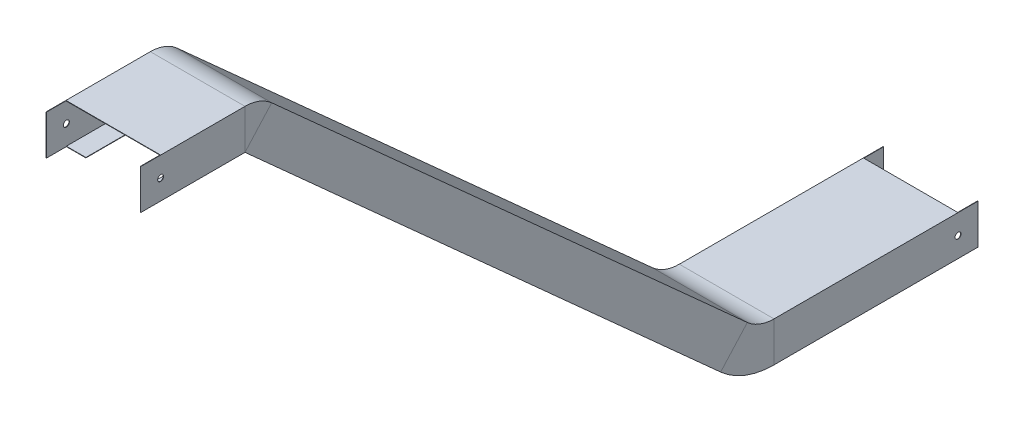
ISO-10303-21;
HEADER;
FILE_DESCRIPTION(('STEP AP214'),'2;1');
FILE_NAME('part.step','',(''),(''),'','','');
FILE_SCHEMA(('AUTOMOTIVE_DESIGN { 1 0 10303 214 1 1 1 1 }'));
ENDSEC;
DATA;
#1=APPLICATION_CONTEXT('core data for automotive mechanical design processes');
#2=APPLICATION_PROTOCOL_DEFINITION('international standard','automotive_design',2000,#1);
#3=PRODUCT_CONTEXT('',#1,'mechanical');
#4=PRODUCT('Part','Part','',(#3));
#5=PRODUCT_RELATED_PRODUCT_CATEGORY('part','',(#4));
#6=PRODUCT_DEFINITION_FORMATION('','',#4);
#7=PRODUCT_DEFINITION_CONTEXT('part definition',#1,'design');
#8=PRODUCT_DEFINITION('design','',#6,#7);
#9=PRODUCT_DEFINITION_SHAPE('','',#8);
#10=(LENGTH_UNIT() NAMED_UNIT(*) SI_UNIT(.MILLI.,.METRE.));
#11=(NAMED_UNIT(*) PLANE_ANGLE_UNIT() SI_UNIT($,.RADIAN.));
#12=(NAMED_UNIT(*) SI_UNIT($,.STERADIAN.) SOLID_ANGLE_UNIT());
#13=UNCERTAINTY_MEASURE_WITH_UNIT(LENGTH_MEASURE(1.E-05),#10,'distance_accuracy_value','');
#14=(GEOMETRIC_REPRESENTATION_CONTEXT(3) GLOBAL_UNCERTAINTY_ASSIGNED_CONTEXT((#13)) GLOBAL_UNIT_ASSIGNED_CONTEXT((#10,
#11,#12)) REPRESENTATION_CONTEXT('',''));
#15=CARTESIAN_POINT('',(0.,0.,0.));
#16=DIRECTION('',(0.,0.,1.));
#17=DIRECTION('',(1.,0.,0.));
#18=AXIS2_PLACEMENT_3D('',#15,#16,#17);
#19=CARTESIAN_POINT('',(0.,0.,-4000.));
#20=DIRECTION('',(0.,0.,1.));
#21=DIRECTION('',(1.,0.,0.));
#22=AXIS2_PLACEMENT_3D('',#19,#20,#21);
#23=PLANE('',#22);
#24=DIRECTION('',(1.,0.,0.));
#25=VECTOR('',#24,1.);
#26=CARTESIAN_POINT('',(-475.,-2650.,-4000.));
#27=LINE('',#26,#25);
#28=CARTESIAN_POINT('',(-471.,-2650.,-4000.));
#29=VERTEX_POINT('',#28);
#30=CARTESIAN_POINT('',(-275.,-2650.,-4000.));
#31=VERTEX_POINT('',#30);
#32=EDGE_CURVE('E447',#29,#31,#27,.T.);
#33=ORIENTED_EDGE('',*,*,#32,.F.);
#34=DIRECTION('',(0.,-1.,0.));
#35=VECTOR('',#34,1.);
#36=CARTESIAN_POINT('',(-471.,-2250.,-4000.));
#37=LINE('',#36,#35);
#38=CARTESIAN_POINT('',(-471.,-2646.,-4000.));
#39=VERTEX_POINT('',#38);
#40=EDGE_CURVE('E320',#39,#29,#37,.T.);
#41=ORIENTED_EDGE('',*,*,#40,.F.);
#42=DIRECTION('',(-1.,0.,0.));
#43=VECTOR('',#42,1.);
#44=CARTESIAN_POINT('',(-471.,-2646.,-4000.));
#45=LINE('',#44,#43);
#46=CARTESIAN_POINT('',(-275.,-2646.,-4000.));
#47=VERTEX_POINT('',#46);
#48=EDGE_CURVE('E543',#47,#39,#45,.T.);
#49=ORIENTED_EDGE('',*,*,#48,.F.);
#50=DIRECTION('',(0.,1.,0.));
#51=VECTOR('',#50,1.);
#52=CARTESIAN_POINT('',(-275.,-2650.,-4000.));
#53=LINE('',#52,#51);
#54=EDGE_CURVE('E510',#31,#47,#53,.T.);
#55=ORIENTED_EDGE('',*,*,#54,.F.);
#56=EDGE_LOOP('',(#33,#41,#49,#55));
#57=FACE_BOUND('',#56,.T.);
#58=ADVANCED_FACE('F39',(#57),#23,.F.);
#59=DIRECTION('',(1.,0.,0.));
#60=VECTOR('',#59,1.);
#61=CARTESIAN_POINT('',(-471.,-2254.,-4000.));
#62=LINE('',#61,#60);
#63=CARTESIAN_POINT('',(-471.,-2254.,-4000.));
#64=VERTEX_POINT('',#63);
#65=CARTESIAN_POINT('',(471.,-2254.,-4000.));
#66=VERTEX_POINT('',#65);
#67=EDGE_CURVE('E586',#64,#66,#62,.T.);
#68=ORIENTED_EDGE('',*,*,#67,.F.);
#69=CARTESIAN_POINT('',(-471.,-2250.,-4000.));
#70=VERTEX_POINT('',#69);
#71=EDGE_CURVE('E351',#70,#64,#37,.T.);
#72=ORIENTED_EDGE('',*,*,#71,.F.);
#73=DIRECTION('',(-1.,0.,0.));
#74=VECTOR('',#73,1.);
#75=CARTESIAN_POINT('',(-475.,-2250.,-4000.));
#76=LINE('',#75,#74);
#77=CARTESIAN_POINT('',(471.,-2250.,-4000.));
#78=VERTEX_POINT('',#77);
#79=EDGE_CURVE('E462',#78,#70,#76,.T.);
#80=ORIENTED_EDGE('',*,*,#79,.F.);
#81=DIRECTION('',(0.,-1.,0.));
#82=VECTOR('',#81,1.);
#83=CARTESIAN_POINT('',(471.,-2250.,-4000.));
#84=LINE('',#83,#82);
#85=EDGE_CURVE('E51',#78,#66,#84,.T.);
#86=ORIENTED_EDGE('',*,*,#85,.T.);
#87=EDGE_LOOP('',(#68,#72,#80,#86));
#88=FACE_BOUND('',#87,.T.);
#89=ADVANCED_FACE('F932',(#88),#23,.F.);
#90=CARTESIAN_POINT('',(0.,4500.,4000.));
#91=DIRECTION('',(0.,0.,1.));
#92=DIRECTION('',(1.,0.,0.));
#93=AXIS2_PLACEMENT_3D('',#90,#91,#92);
#94=PLANE('',#93);
#95=DIRECTION('',(0.,1.,0.));
#96=VECTOR('',#95,1.);
#97=CARTESIAN_POINT('',(-471.,2250.,4000.));
#98=LINE('',#97,#96);
#99=CARTESIAN_POINT('',(-471.,1850.,4000.));
#100=VERTEX_POINT('',#99);
#101=CARTESIAN_POINT('',(-471.,1854.,4000.));
#102=VERTEX_POINT('',#101);
#103=EDGE_CURVE('E65',#100,#102,#98,.T.);
#104=ORIENTED_EDGE('',*,*,#103,.F.);
#105=DIRECTION('',(1.,0.,0.));
#106=VECTOR('',#105,1.);
#107=CARTESIAN_POINT('',(-475.,1850.,4000.));
#108=LINE('',#107,#106);
#109=CARTESIAN_POINT('',(-275.,1850.,4000.));
#110=VERTEX_POINT('',#109);
#111=EDGE_CURVE('E503',#100,#110,#108,.T.);
#112=ORIENTED_EDGE('',*,*,#111,.T.);
#113=DIRECTION('',(0.,1.,0.));
#114=VECTOR('',#113,1.);
#115=CARTESIAN_POINT('',(-275.,1850.,4000.));
#116=LINE('',#115,#114);
#117=CARTESIAN_POINT('',(-275.,1854.,4000.));
#118=VERTEX_POINT('',#117);
#119=EDGE_CURVE('E539',#110,#118,#116,.T.);
#120=ORIENTED_EDGE('',*,*,#119,.T.);
#121=DIRECTION('',(-1.,0.,0.));
#122=VECTOR('',#121,1.);
#123=CARTESIAN_POINT('',(-471.,1854.,4000.));
#124=LINE('',#123,#122);
#125=EDGE_CURVE('E582',#118,#102,#124,.T.);
#126=ORIENTED_EDGE('',*,*,#125,.T.);
#127=EDGE_LOOP('',(#104,#112,#120,#126));
#128=FACE_BOUND('',#127,.T.);
#129=ADVANCED_FACE('F1011',(#128),#94,.T.);
#130=DIRECTION('',(1.,0.,0.));
#131=VECTOR('',#130,1.);
#132=CARTESIAN_POINT('',(275.,1850.,4000.));
#133=LINE('',#132,#131);
#134=CARTESIAN_POINT('',(275.,1850.,4000.));
#135=VERTEX_POINT('',#134);
#136=CARTESIAN_POINT('',(471.,1850.,4000.));
#137=VERTEX_POINT('',#136);
#138=EDGE_CURVE('E821',#135,#137,#133,.T.);
#139=ORIENTED_EDGE('',*,*,#138,.T.);
#140=DIRECTION('',(0.,1.,0.));
#141=VECTOR('',#140,1.);
#142=CARTESIAN_POINT('',(471.,2250.,4000.));
#143=LINE('',#142,#141);
#144=CARTESIAN_POINT('',(471.,1854.,4000.));
#145=VERTEX_POINT('',#144);
#146=EDGE_CURVE('E432',#137,#145,#143,.T.);
#147=ORIENTED_EDGE('',*,*,#146,.T.);
#148=DIRECTION('',(-1.,0.,0.));
#149=VECTOR('',#148,1.);
#150=CARTESIAN_POINT('',(275.,1854.,4000.));
#151=LINE('',#150,#149);
#152=CARTESIAN_POINT('',(275.,1854.,4000.));
#153=VERTEX_POINT('',#152);
#154=EDGE_CURVE('E740',#145,#153,#151,.T.);
#155=ORIENTED_EDGE('',*,*,#154,.T.);
#156=DIRECTION('',(0.,-1.,0.));
#157=VECTOR('',#156,1.);
#158=CARTESIAN_POINT('',(275.,1850.,4000.));
#159=LINE('',#158,#157);
#160=EDGE_CURVE('E783',#153,#135,#159,.T.);
#161=ORIENTED_EDGE('',*,*,#160,.T.);
#162=EDGE_LOOP('',(#139,#147,#155,#161));
#163=FACE_BOUND('',#162,.T.);
#164=ADVANCED_FACE('F1024',(#163),#94,.T.);
#165=CARTESIAN_POINT('',(-471.,2246.,4000.));
#166=VERTEX_POINT('',#165);
#167=CARTESIAN_POINT('',(-471.,2250.,4000.));
#168=VERTEX_POINT('',#167);
#169=EDGE_CURVE('E405',#166,#168,#98,.T.);
#170=ORIENTED_EDGE('',*,*,#169,.F.);
#171=DIRECTION('',(1.,0.,0.));
#172=VECTOR('',#171,1.);
#173=CARTESIAN_POINT('',(-471.,2246.,4000.));
#174=LINE('',#173,#172);
#175=CARTESIAN_POINT('',(471.,2246.,4000.));
#176=VERTEX_POINT('',#175);
#177=EDGE_CURVE('E660',#166,#176,#174,.T.);
#178=ORIENTED_EDGE('',*,*,#177,.T.);
#179=CARTESIAN_POINT('',(471.,2250.,4000.));
#180=VERTEX_POINT('',#179);
#181=EDGE_CURVE('E49',#176,#180,#143,.T.);
#182=ORIENTED_EDGE('',*,*,#181,.T.);
#183=DIRECTION('',(-1.,0.,0.));
#184=VECTOR('',#183,1.);
#185=CARTESIAN_POINT('',(-475.,2250.,4000.));
#186=LINE('',#185,#184);
#187=EDGE_CURVE('E43',#180,#168,#186,.T.);
#188=ORIENTED_EDGE('',*,*,#187,.T.);
#189=EDGE_LOOP('',(#170,#178,#182,#188));
#190=FACE_BOUND('',#189,.T.);
#191=ADVANCED_FACE('F1013',(#190),#94,.T.);
#192=DIRECTION('',(-1.,0.,0.));
#193=VECTOR('',#192,1.);
#194=CARTESIAN_POINT('',(275.,-2646.,-4000.));
#195=LINE('',#194,#193);
#196=CARTESIAN_POINT('',(471.,-2646.,-4000.));
#197=VERTEX_POINT('',#196);
#198=CARTESIAN_POINT('',(275.,-2646.,-4000.));
#199=VERTEX_POINT('',#198);
#200=EDGE_CURVE('E664',#197,#199,#195,.T.);
#201=ORIENTED_EDGE('',*,*,#200,.F.);
#202=CARTESIAN_POINT('',(471.,-2650.,-4000.));
#203=VERTEX_POINT('',#202);
#204=EDGE_CURVE('E11',#197,#203,#84,.T.);
#205=ORIENTED_EDGE('',*,*,#204,.T.);
#206=DIRECTION('',(1.,0.,0.));
#207=VECTOR('',#206,1.);
#208=CARTESIAN_POINT('',(275.,-2650.,-4000.));
#209=LINE('',#208,#207);
#210=CARTESIAN_POINT('',(275.,-2650.,-4000.));
#211=VERTEX_POINT('',#210);
#212=EDGE_CURVE('E787',#211,#203,#209,.T.);
#213=ORIENTED_EDGE('',*,*,#212,.F.);
#214=DIRECTION('',(0.,-1.,0.));
#215=VECTOR('',#214,1.);
#216=CARTESIAN_POINT('',(275.,-2650.,-4000.));
#217=LINE('',#216,#215);
#218=EDGE_CURVE('E744',#199,#211,#217,.T.);
#219=ORIENTED_EDGE('',*,*,#218,.F.);
#220=EDGE_LOOP('',(#201,#205,#213,#219));
#221=FACE_BOUND('',#220,.T.);
#222=ADVANCED_FACE('F41',(#221),#23,.F.);
#223=CARTESIAN_POINT('',(-475.,-2250.,-4000.));
#224=DIRECTION('',(-1.,0.,0.));
#225=DIRECTION('',(0.,-1.,0.));
#226=AXIS2_PLACEMENT_3D('',#223,#224,#225);
#227=PLANE('',#226);
#228=CARTESIAN_POINT('',(-475.,-2450.,-4000.));
#229=DIRECTION('',(1.,0.,0.));
#230=DIRECTION('',(0.,0.,-1.));
#231=AXIS2_PLACEMENT_3D('',#228,#229,#230);
#232=CIRCLE('',#231,29.9999999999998);
#233=CARTESIAN_POINT('',(-475.,-2450.,-4030.));
#234=VERTEX_POINT('',#233);
#235=EDGE_CURVE('E1186',#234,#234,#232,.T.);
#236=ORIENTED_EDGE('',*,*,#235,.T.);
#237=EDGE_LOOP('',(#236));
#238=FACE_BOUND('',#237,.T.);
#239=DIRECTION('',(0.,0.,1.));
#240=VECTOR('',#239,1.);
#241=CARTESIAN_POINT('',(-475.,-2650.,-4000.));
#242=LINE('',#241,#240);
#243=CARTESIAN_POINT('',(-475.,-2650.,-4200.));
#244=VERTEX_POINT('',#243);
#245=CARTESIAN_POINT('',(-475.,-2650.,-2153.49440209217));
#246=VERTEX_POINT('',#245);
#247=EDGE_CURVE('E331',#244,#246,#242,.T.);
#248=ORIENTED_EDGE('',*,*,#247,.T.);
#249=DIRECTION('',(0.,-1.,0.));
#250=VECTOR('',#249,1.);
#251=CARTESIAN_POINT('',(-475.,-2250.,-2153.49440209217));
#252=LINE('',#251,#250);
#253=CARTESIAN_POINT('',(-475.,-2250.,-2153.49440209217));
#254=VERTEX_POINT('',#253);
#255=EDGE_CURVE('E451',#254,#246,#252,.T.);
#256=ORIENTED_EDGE('',*,*,#255,.F.);
#257=DIRECTION('',(0.,0.,1.));
#258=VECTOR('',#257,1.);
#259=CARTESIAN_POINT('',(-475.,-2250.,-4000.));
#260=LINE('',#259,#258);
#261=CARTESIAN_POINT('',(-475.,-2250.,-4200.));
#262=VERTEX_POINT('',#261);
#263=EDGE_CURVE('E455',#262,#254,#260,.T.);
#264=ORIENTED_EDGE('',*,*,#263,.F.);
#265=DIRECTION('',(0.,1.,0.));
#266=VECTOR('',#265,1.);
#267=CARTESIAN_POINT('',(-475.,-2650.,-4200.));
#268=LINE('',#267,#266);
#269=EDGE_CURVE('E342',#244,#262,#268,.T.);
#270=ORIENTED_EDGE('',*,*,#269,.F.);
#271=EDGE_LOOP('',(#248,#256,#264,#270));
#272=FACE_BOUND('',#271,.T.);
#273=ADVANCED_FACE('F926',(#238,#272),#227,.T.);
#274=CARTESIAN_POINT('',(-475.,-2650.,-4000.));
#275=DIRECTION('',(0.,-1.,0.));
#276=DIRECTION('',(0.,0.,-1.));
#277=AXIS2_PLACEMENT_3D('',#274,#275,#276);
#278=PLANE('',#277);
#279=DIRECTION('',(0.,0.,1.));
#280=VECTOR('',#279,1.);
#281=CARTESIAN_POINT('',(-275.,-2650.,-4000.));
#282=LINE('',#281,#280);
#283=CARTESIAN_POINT('',(-275.,-2650.,-2153.49440209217));
#284=VERTEX_POINT('',#283);
#285=EDGE_CURVE('E514',#31,#284,#282,.T.);
#286=ORIENTED_EDGE('',*,*,#285,.T.);
#287=DIRECTION('',(1.,0.,0.));
#288=VECTOR('',#287,1.);
#289=CARTESIAN_POINT('',(-475.,-2650.,-2153.49440209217));
#290=LINE('',#289,#288);
#291=EDGE_CURVE('E458',#246,#284,#290,.T.);
#292=ORIENTED_EDGE('',*,*,#291,.F.);
#293=ORIENTED_EDGE('',*,*,#247,.F.);
#294=DIRECTION('',(-1.,0.,0.));
#295=VECTOR('',#294,1.);
#296=CARTESIAN_POINT('',(-471.,-2650.,-4200.));
#297=LINE('',#296,#295);
#298=CARTESIAN_POINT('',(-471.,-2650.,-4200.));
#299=VERTEX_POINT('',#298);
#300=EDGE_CURVE('E326',#299,#244,#297,.T.);
#301=ORIENTED_EDGE('',*,*,#300,.F.);
#302=DIRECTION('',(0.,0.,-1.));
#303=VECTOR('',#302,1.);
#304=CARTESIAN_POINT('',(-471.,-2650.,-4000.));
#305=LINE('',#304,#303);
#306=EDGE_CURVE('E312',#29,#299,#305,.T.);
#307=ORIENTED_EDGE('',*,*,#306,.F.);
#308=ORIENTED_EDGE('',*,*,#32,.T.);
#309=EDGE_LOOP('',(#286,#292,#293,#301,#307,#308));
#310=FACE_BOUND('',#309,.T.);
#311=ADVANCED_FACE('F328',(#310),#278,.T.);
#312=CARTESIAN_POINT('',(-275.,-2650.,-4000.));
#313=DIRECTION('',(1.,0.,0.));
#314=DIRECTION('',(0.,0.,-1.));
#315=AXIS2_PLACEMENT_3D('',#312,#313,#314);
#316=PLANE('',#315);
#317=DIRECTION('',(0.,0.,1.));
#318=VECTOR('',#317,1.);
#319=CARTESIAN_POINT('',(-275.,-2646.,-4000.));
#320=LINE('',#319,#318);
#321=CARTESIAN_POINT('',(-275.,-2646.,-2153.49440209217));
#322=VERTEX_POINT('',#321);
#323=EDGE_CURVE('E547',#47,#322,#320,.T.);
#324=ORIENTED_EDGE('',*,*,#323,.T.);
#325=DIRECTION('',(0.,1.,0.));
#326=VECTOR('',#325,1.);
#327=CARTESIAN_POINT('',(-275.,-2650.,-2153.49440209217));
#328=LINE('',#327,#326);
#329=EDGE_CURVE('E517',#284,#322,#328,.T.);
#330=ORIENTED_EDGE('',*,*,#329,.F.);
#331=ORIENTED_EDGE('',*,*,#285,.F.);
#332=ORIENTED_EDGE('',*,*,#54,.T.);
#333=EDGE_LOOP('',(#324,#330,#331,#332));
#334=FACE_BOUND('',#333,.T.);
#335=ADVANCED_FACE('F974',(#334),#316,.T.);
#336=CARTESIAN_POINT('',(-471.,-2646.,-4000.));
#337=DIRECTION('',(0.,1.,0.));
#338=DIRECTION('',(0.,0.,1.));
#339=AXIS2_PLACEMENT_3D('',#336,#337,#338);
#340=PLANE('',#339);
#341=DIRECTION('',(0.,0.,1.));
#342=VECTOR('',#341,1.);
#343=CARTESIAN_POINT('',(-471.,-2646.,-4000.));
#344=LINE('',#343,#342);
#345=CARTESIAN_POINT('',(-471.,-2646.,-2153.49440209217));
#346=VERTEX_POINT('',#345);
#347=EDGE_CURVE('E590',#39,#346,#344,.T.);
#348=ORIENTED_EDGE('',*,*,#347,.T.);
#349=DIRECTION('',(-1.,0.,0.));
#350=VECTOR('',#349,1.);
#351=CARTESIAN_POINT('',(-471.,-2646.,-2153.49440209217));
#352=LINE('',#351,#350);
#353=EDGE_CURVE('E551',#322,#346,#352,.T.);
#354=ORIENTED_EDGE('',*,*,#353,.F.);
#355=ORIENTED_EDGE('',*,*,#323,.F.);
#356=ORIENTED_EDGE('',*,*,#48,.T.);
#357=EDGE_LOOP('',(#348,#354,#355,#356));
#358=FACE_BOUND('',#357,.T.);
#359=ADVANCED_FACE('F977',(#358),#340,.T.);
#360=CARTESIAN_POINT('',(-471.,-2254.,-4000.));
#361=DIRECTION('',(1.,0.,0.));
#362=DIRECTION('',(0.,0.,-1.));
#363=AXIS2_PLACEMENT_3D('',#360,#361,#362);
#364=PLANE('',#363);
#365=CARTESIAN_POINT('',(-471.,-2450.,-4000.));
#366=DIRECTION('',(1.,0.,0.));
#367=DIRECTION('',(0.,0.,-1.));
#368=AXIS2_PLACEMENT_3D('',#365,#366,#367);
#369=CIRCLE('',#368,29.9999999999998);
#370=CARTESIAN_POINT('',(-471.,-2450.,-4030.));
#371=VERTEX_POINT('',#370);
#372=EDGE_CURVE('E1181',#371,#371,#369,.T.);
#373=ORIENTED_EDGE('',*,*,#372,.F.);
#374=EDGE_LOOP('',(#373));
#375=FACE_BOUND('',#374,.T.);
#376=DIRECTION('',(0.,0.,1.));
#377=VECTOR('',#376,1.);
#378=CARTESIAN_POINT('',(-471.,-2254.,-4000.));
#379=LINE('',#378,#377);
#380=CARTESIAN_POINT('',(-471.,-2254.,-2153.49440209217));
#381=VERTEX_POINT('',#380);
#382=EDGE_CURVE('E629',#64,#381,#379,.T.);
#383=ORIENTED_EDGE('',*,*,#382,.T.);
#384=DIRECTION('',(0.,1.,0.));
#385=VECTOR('',#384,1.);
#386=CARTESIAN_POINT('',(-471.,-2254.,-2153.49440209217));
#387=LINE('',#386,#385);
#388=EDGE_CURVE('E594',#346,#381,#387,.T.);
#389=ORIENTED_EDGE('',*,*,#388,.F.);
#390=ORIENTED_EDGE('',*,*,#347,.F.);
#391=ORIENTED_EDGE('',*,*,#40,.T.);
#392=ORIENTED_EDGE('',*,*,#306,.T.);
#393=DIRECTION('',(0.,1.,0.));
#394=VECTOR('',#393,1.);
#395=CARTESIAN_POINT('',(-471.,-2650.,-4200.));
#396=LINE('',#395,#394);
#397=CARTESIAN_POINT('',(-471.,-2250.,-4200.));
#398=VERTEX_POINT('',#397);
#399=EDGE_CURVE('E317',#299,#398,#396,.T.);
#400=ORIENTED_EDGE('',*,*,#399,.T.);
#401=DIRECTION('',(0.,0.,1.));
#402=VECTOR('',#401,1.);
#403=CARTESIAN_POINT('',(-471.,-2250.,-4000.));
#404=LINE('',#403,#402);
#405=EDGE_CURVE('E337',#398,#70,#404,.T.);
#406=ORIENTED_EDGE('',*,*,#405,.T.);
#407=ORIENTED_EDGE('',*,*,#71,.T.);
#408=EDGE_LOOP('',(#383,#389,#390,#391,#392,#400,#406,#407));
#409=FACE_BOUND('',#408,.T.);
#410=ADVANCED_FACE('F315',(#375,#409),#364,.T.);
#411=CARTESIAN_POINT('',(-471.,-2254.,-4000.));
#412=DIRECTION('',(0.,-1.,0.));
#413=DIRECTION('',(0.,0.,-1.));
#414=AXIS2_PLACEMENT_3D('',#411,#412,#413);
#415=PLANE('',#414);
#416=DIRECTION('',(0.,0.,1.));
#417=VECTOR('',#416,1.);
#418=CARTESIAN_POINT('',(471.,-2254.,-4000.));
#419=LINE('',#418,#417);
#420=CARTESIAN_POINT('',(471.,-2254.,-2153.49440209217));
#421=VERTEX_POINT('',#420);
#422=EDGE_CURVE('E668',#66,#421,#419,.T.);
#423=ORIENTED_EDGE('',*,*,#422,.T.);
#424=DIRECTION('',(1.,0.,0.));
#425=VECTOR('',#424,1.);
#426=CARTESIAN_POINT('',(-471.,-2254.,-2153.49440209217));
#427=LINE('',#426,#425);
#428=EDGE_CURVE('E632',#381,#421,#427,.T.);
#429=ORIENTED_EDGE('',*,*,#428,.F.);
#430=ORIENTED_EDGE('',*,*,#382,.F.);
#431=ORIENTED_EDGE('',*,*,#67,.T.);
#432=EDGE_LOOP('',(#423,#429,#430,#431));
#433=FACE_BOUND('',#432,.T.);
#434=ADVANCED_FACE('F937',(#433),#415,.T.);
#435=CARTESIAN_POINT('',(471.,-2254.,-4000.));
#436=DIRECTION('',(-1.,0.,0.));
#437=DIRECTION('',(0.,-1.,0.));
#438=AXIS2_PLACEMENT_3D('',#435,#436,#437);
#439=PLANE('',#438);
#440=CARTESIAN_POINT('',(471.,-2450.,-4000.));
#441=DIRECTION('',(1.,0.,0.));
#442=DIRECTION('',(0.,0.,-1.));
#443=AXIS2_PLACEMENT_3D('',#440,#441,#442);
#444=CIRCLE('',#443,29.9999999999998);
#445=CARTESIAN_POINT('',(471.,-2450.,-4030.));
#446=VERTEX_POINT('',#445);
#447=EDGE_CURVE('E345',#446,#446,#444,.T.);
#448=ORIENTED_EDGE('',*,*,#447,.T.);
#449=EDGE_LOOP('',(#448));
#450=FACE_BOUND('',#449,.T.);
#451=DIRECTION('',(0.,0.,1.));
#452=VECTOR('',#451,1.);
#453=CARTESIAN_POINT('',(471.,-2646.,-4000.));
#454=LINE('',#453,#452);
#455=CARTESIAN_POINT('',(471.,-2646.,-2153.49440209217));
#456=VERTEX_POINT('',#455);
#457=EDGE_CURVE('E708',#197,#456,#454,.T.);
#458=ORIENTED_EDGE('',*,*,#457,.T.);
#459=DIRECTION('',(0.,-1.,0.));
#460=VECTOR('',#459,1.);
#461=CARTESIAN_POINT('',(471.,-2254.,-2153.49440209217));
#462=LINE('',#461,#460);
#463=EDGE_CURVE('E672',#421,#456,#462,.T.);
#464=ORIENTED_EDGE('',*,*,#463,.F.);
#465=ORIENTED_EDGE('',*,*,#422,.F.);
#466=ORIENTED_EDGE('',*,*,#85,.F.);
#467=DIRECTION('',(0.,0.,1.));
#468=VECTOR('',#467,1.);
#469=CARTESIAN_POINT('',(471.,-2250.,-4000.));
#470=LINE('',#469,#468);
#471=CARTESIAN_POINT('',(471.,-2250.,-4200.));
#472=VERTEX_POINT('',#471);
#473=EDGE_CURVE('E363',#472,#78,#470,.T.);
#474=ORIENTED_EDGE('',*,*,#473,.F.);
#475=DIRECTION('',(0.,1.,0.));
#476=VECTOR('',#475,1.);
#477=CARTESIAN_POINT('',(471.,-2650.,-4200.));
#478=LINE('',#477,#476);
#479=CARTESIAN_POINT('',(471.,-2650.,-4200.));
#480=VERTEX_POINT('',#479);
#481=EDGE_CURVE('E359',#480,#472,#478,.T.);
#482=ORIENTED_EDGE('',*,*,#481,.F.);
#483=DIRECTION('',(0.,0.,-1.));
#484=VECTOR('',#483,1.);
#485=CARTESIAN_POINT('',(471.,-2650.,-4000.));
#486=LINE('',#485,#484);
#487=EDGE_CURVE('E58',#203,#480,#486,.T.);
#488=ORIENTED_EDGE('',*,*,#487,.F.);
#489=ORIENTED_EDGE('',*,*,#204,.F.);
#490=EDGE_LOOP('',(#458,#464,#465,#466,#474,#482,#488,#489));
#491=FACE_BOUND('',#490,.T.);
#492=ADVANCED_FACE('F1137',(#450,#491),#439,.T.);
#493=CARTESIAN_POINT('',(275.,-2646.,-4000.));
#494=DIRECTION('',(0.,1.,0.));
#495=DIRECTION('',(0.,0.,1.));
#496=AXIS2_PLACEMENT_3D('',#493,#494,#495);
#497=PLANE('',#496);
#498=DIRECTION('',(0.,0.,1.));
#499=VECTOR('',#498,1.);
#500=CARTESIAN_POINT('',(275.,-2646.,-4000.));
#501=LINE('',#500,#499);
#502=CARTESIAN_POINT('',(275.,-2646.,-2153.49440209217));
#503=VERTEX_POINT('',#502);
#504=EDGE_CURVE('E748',#199,#503,#501,.T.);
#505=ORIENTED_EDGE('',*,*,#504,.T.);
#506=DIRECTION('',(-1.,0.,0.));
#507=VECTOR('',#506,1.);
#508=CARTESIAN_POINT('',(275.,-2646.,-2153.49440209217));
#509=LINE('',#508,#507);
#510=EDGE_CURVE('E712',#456,#503,#509,.T.);
#511=ORIENTED_EDGE('',*,*,#510,.F.);
#512=ORIENTED_EDGE('',*,*,#457,.F.);
#513=ORIENTED_EDGE('',*,*,#200,.T.);
#514=EDGE_LOOP('',(#505,#511,#512,#513));
#515=FACE_BOUND('',#514,.T.);
#516=ADVANCED_FACE('F1140',(#515),#497,.T.);
#517=CARTESIAN_POINT('',(275.,-2650.,-4000.));
#518=DIRECTION('',(-1.,0.,0.));
#519=DIRECTION('',(0.,-1.,0.));
#520=AXIS2_PLACEMENT_3D('',#517,#518,#519);
#521=PLANE('',#520);
#522=DIRECTION('',(0.,0.,1.));
#523=VECTOR('',#522,1.);
#524=CARTESIAN_POINT('',(275.,-2650.,-4000.));
#525=LINE('',#524,#523);
#526=CARTESIAN_POINT('',(275.,-2650.,-2153.49440209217));
#527=VERTEX_POINT('',#526);
#528=EDGE_CURVE('E791',#211,#527,#525,.T.);
#529=ORIENTED_EDGE('',*,*,#528,.T.);
#530=DIRECTION('',(0.,-1.,0.));
#531=VECTOR('',#530,1.);
#532=CARTESIAN_POINT('',(275.,-2650.,-2153.49440209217));
#533=LINE('',#532,#531);
#534=EDGE_CURVE('E752',#503,#527,#533,.T.);
#535=ORIENTED_EDGE('',*,*,#534,.F.);
#536=ORIENTED_EDGE('',*,*,#504,.F.);
#537=ORIENTED_EDGE('',*,*,#218,.T.);
#538=EDGE_LOOP('',(#529,#535,#536,#537));
#539=FACE_BOUND('',#538,.T.);
#540=ADVANCED_FACE('F1143',(#539),#521,.T.);
#541=CARTESIAN_POINT('',(275.,-2650.,-4000.));
#542=DIRECTION('',(0.,-1.,0.));
#543=DIRECTION('',(0.,0.,-1.));
#544=AXIS2_PLACEMENT_3D('',#541,#542,#543);
#545=PLANE('',#544);
#546=DIRECTION('',(0.,0.,1.));
#547=VECTOR('',#546,1.);
#548=CARTESIAN_POINT('',(475.,-2650.,-4000.));
#549=LINE('',#548,#547);
#550=CARTESIAN_POINT('',(475.,-2650.,-4200.));
#551=VERTEX_POINT('',#550);
#552=CARTESIAN_POINT('',(475.,-2650.,-2153.49440209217));
#553=VERTEX_POINT('',#552);
#554=EDGE_CURVE('E828',#551,#553,#549,.T.);
#555=ORIENTED_EDGE('',*,*,#554,.T.);
#556=DIRECTION('',(1.,0.,0.));
#557=VECTOR('',#556,1.);
#558=CARTESIAN_POINT('',(275.,-2650.,-2153.49440209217));
#559=LINE('',#558,#557);
#560=EDGE_CURVE('E795',#527,#553,#559,.T.);
#561=ORIENTED_EDGE('',*,*,#560,.F.);
#562=ORIENTED_EDGE('',*,*,#528,.F.);
#563=ORIENTED_EDGE('',*,*,#212,.T.);
#564=ORIENTED_EDGE('',*,*,#487,.T.);
#565=DIRECTION('',(1.,0.,0.));
#566=VECTOR('',#565,1.);
#567=CARTESIAN_POINT('',(471.,-2650.,-4200.));
#568=LINE('',#567,#566);
#569=EDGE_CURVE('E374',#480,#551,#568,.T.);
#570=ORIENTED_EDGE('',*,*,#569,.T.);
#571=EDGE_LOOP('',(#555,#561,#562,#563,#564,#570));
#572=FACE_BOUND('',#571,.T.);
#573=ADVANCED_FACE('F1146',(#572),#545,.T.);
#574=CARTESIAN_POINT('',(475.,-2250.,-4000.));
#575=DIRECTION('',(1.,0.,0.));
#576=DIRECTION('',(0.,0.,-1.));
#577=AXIS2_PLACEMENT_3D('',#574,#575,#576);
#578=PLANE('',#577);
#579=CARTESIAN_POINT('',(475.,-2450.,-4000.));
#580=DIRECTION('',(1.,0.,0.));
#581=DIRECTION('',(0.,0.,-1.));
#582=AXIS2_PLACEMENT_3D('',#579,#580,#581);
#583=CIRCLE('',#582,29.9999999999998);
#584=CARTESIAN_POINT('',(475.,-2450.,-4030.));
#585=VERTEX_POINT('',#584);
#586=EDGE_CURVE('E348',#585,#585,#583,.T.);
#587=ORIENTED_EDGE('',*,*,#586,.F.);
#588=EDGE_LOOP('',(#587));
#589=FACE_BOUND('',#588,.T.);
#590=DIRECTION('',(0.,0.,1.));
#591=VECTOR('',#590,1.);
#592=CARTESIAN_POINT('',(475.,-2250.,-4000.));
#593=LINE('',#592,#591);
#594=CARTESIAN_POINT('',(475.,-2250.,-4200.));
#595=VERTEX_POINT('',#594);
#596=CARTESIAN_POINT('',(475.,-2250.,-2153.49440209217));
#597=VERTEX_POINT('',#596);
#598=EDGE_CURVE('E858',#595,#597,#593,.T.);
#599=ORIENTED_EDGE('',*,*,#598,.T.);
#600=DIRECTION('',(0.,1.,0.));
#601=VECTOR('',#600,1.);
#602=CARTESIAN_POINT('',(475.,-2250.,-2153.49440209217));
#603=LINE('',#602,#601);
#604=EDGE_CURVE('E832',#553,#597,#603,.T.);
#605=ORIENTED_EDGE('',*,*,#604,.F.);
#606=ORIENTED_EDGE('',*,*,#554,.F.);
#607=DIRECTION('',(0.,1.,0.));
#608=VECTOR('',#607,1.);
#609=CARTESIAN_POINT('',(475.,-2650.,-4200.));
#610=LINE('',#609,#608);
#611=EDGE_CURVE('E357',#551,#595,#610,.T.);
#612=ORIENTED_EDGE('',*,*,#611,.T.);
#613=EDGE_LOOP('',(#599,#605,#606,#612));
#614=FACE_BOUND('',#613,.T.);
#615=ADVANCED_FACE('F1150',(#589,#614),#578,.T.);
#616=CARTESIAN_POINT('',(-475.,-2250.,-4000.));
#617=DIRECTION('',(0.,1.,0.));
#618=DIRECTION('',(0.,0.,1.));
#619=AXIS2_PLACEMENT_3D('',#616,#617,#618);
#620=PLANE('',#619);
#621=DIRECTION('',(-1.,0.,0.));
#622=VECTOR('',#621,1.);
#623=CARTESIAN_POINT('',(-475.,-2250.,-2153.49440209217));
#624=LINE('',#623,#622);
#625=EDGE_CURVE('E476',#597,#254,#624,.T.);
#626=ORIENTED_EDGE('',*,*,#625,.F.);
#627=ORIENTED_EDGE('',*,*,#598,.F.);
#628=DIRECTION('',(1.,0.,0.));
#629=VECTOR('',#628,1.);
#630=CARTESIAN_POINT('',(471.,-2250.,-4200.));
#631=LINE('',#630,#629);
#632=EDGE_CURVE('E370',#472,#595,#631,.T.);
#633=ORIENTED_EDGE('',*,*,#632,.F.);
#634=ORIENTED_EDGE('',*,*,#473,.T.);
#635=ORIENTED_EDGE('',*,*,#79,.T.);
#636=ORIENTED_EDGE('',*,*,#405,.F.);
#637=DIRECTION('',(-1.,0.,0.));
#638=VECTOR('',#637,1.);
#639=CARTESIAN_POINT('',(-471.,-2250.,-4200.));
#640=LINE('',#639,#638);
#641=EDGE_CURVE('E336',#398,#262,#640,.T.);
#642=ORIENTED_EDGE('',*,*,#641,.T.);
#643=ORIENTED_EDGE('',*,*,#263,.T.);
#644=EDGE_LOOP('',(#626,#627,#633,#634,#635,#636,#642,#643));
#645=FACE_BOUND('',#644,.T.);
#646=ADVANCED_FACE('F927',(#645),#620,.T.);
#647=CARTESIAN_POINT('',(-475.,-2250.00000000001,-2153.49440209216));
#648=DIRECTION('',(-1.,0.,0.));
#649=DIRECTION('',(0.,0.,1.));
#650=AXIS2_PLACEMENT_3D('',#647,#648,#649);
#651=PLANE('',#650);
#652=CARTESIAN_POINT('',(-475.,-1850.,-2153.49440209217));
#653=DIRECTION('',(-1.,0.,0.));
#654=DIRECTION('',(0.,-1.,0.));
#655=AXIS2_PLACEMENT_3D('',#652,#653,#654);
#656=CIRCLE('',#655,800.000000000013);
#657=CARTESIAN_POINT('',(-475.,-2444.63531699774,-1618.32261679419));
#658=VERTEX_POINT('',#657);
#659=EDGE_CURVE('E467',#246,#658,#656,.T.);
#660=ORIENTED_EDGE('',*,*,#659,.T.);
#661=DIRECTION('',(0.,-0.743294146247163,0.668964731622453));
#662=VECTOR('',#661,1.);
#663=CARTESIAN_POINT('',(-475.,-2147.31765849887,-1885.90850944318));
#664=LINE('',#663,#662);
#665=CARTESIAN_POINT('',(-475.,-2147.31765849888,-1885.90850944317));
#666=VERTEX_POINT('',#665);
#667=EDGE_CURVE('E463',#666,#658,#664,.T.);
#668=ORIENTED_EDGE('',*,*,#667,.F.);
#669=CARTESIAN_POINT('',(-475.,-1850.,-2153.49440209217));
#670=DIRECTION('',(-1.,0.,0.));
#671=DIRECTION('',(0.,-1.,0.));
#672=AXIS2_PLACEMENT_3D('',#669,#670,#671);
#673=CIRCLE('',#672,400.000000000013);
#674=EDGE_CURVE('E468',#254,#666,#673,.T.);
#675=ORIENTED_EDGE('',*,*,#674,.F.);
#676=ORIENTED_EDGE('',*,*,#255,.T.);
#677=EDGE_LOOP('',(#660,#668,#675,#676));
#678=FACE_BOUND('',#677,.T.);
#679=ADVANCED_FACE('F920',(#678),#651,.T.);
#680=CARTESIAN_POINT('',(0.,-1850.,-2153.49440209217));
#681=DIRECTION('',(-1.,0.,0.));
#682=DIRECTION('',(0.,0.,1.));
#683=AXIS2_PLACEMENT_3D('',#680,#681,#682);
#684=CYLINDRICAL_SURFACE('',#683,800.000000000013);
#685=CARTESIAN_POINT('',(-275.,-1850.,-2153.49440209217));
#686=DIRECTION('',(-1.,0.,0.));
#687=DIRECTION('',(0.,-1.,0.));
#688=AXIS2_PLACEMENT_3D('',#685,#686,#687);
#689=CIRCLE('',#688,800.000000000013);
#690=CARTESIAN_POINT('',(-275.,-2444.63531699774,-1618.32261679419));
#691=VERTEX_POINT('',#690);
#692=EDGE_CURVE('E521',#284,#691,#689,.T.);
#693=ORIENTED_EDGE('',*,*,#692,.T.);
#694=DIRECTION('',(1.,0.,0.));
#695=VECTOR('',#694,1.);
#696=CARTESIAN_POINT('',(-475.,-2444.63531699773,-1618.3226167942));
#697=LINE('',#696,#695);
#698=EDGE_CURVE('E472',#658,#691,#697,.T.);
#699=ORIENTED_EDGE('',*,*,#698,.F.);
#700=ORIENTED_EDGE('',*,*,#659,.F.);
#701=ORIENTED_EDGE('',*,*,#291,.T.);
#702=EDGE_LOOP('',(#693,#699,#700,#701));
#703=FACE_BOUND('',#702,.T.);
#704=ADVANCED_FACE('F970',(#703),#684,.T.);
#705=CARTESIAN_POINT('',(-275.,-2650.00000000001,-2153.49440209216));
#706=DIRECTION('',(1.,0.,0.));
#707=DIRECTION('',(0.,0.,-1.));
#708=AXIS2_PLACEMENT_3D('',#705,#706,#707);
#709=PLANE('',#708);
#710=CARTESIAN_POINT('',(-275.,-1850.,-2153.49440209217));
#711=DIRECTION('',(-1.,0.,0.));
#712=DIRECTION('',(0.,-1.,0.));
#713=AXIS2_PLACEMENT_3D('',#710,#711,#712);
#714=CIRCLE('',#713,796.000000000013);
#715=CARTESIAN_POINT('',(-275.,-2441.66214041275,-1620.99847572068));
#716=VERTEX_POINT('',#715);
#717=EDGE_CURVE('E555',#322,#716,#714,.T.);
#718=ORIENTED_EDGE('',*,*,#717,.T.);
#719=DIRECTION('',(0.,0.743294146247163,-0.668964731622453));
#720=VECTOR('',#719,1.);
#721=CARTESIAN_POINT('',(-275.,-2444.63531699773,-1618.3226167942));
#722=LINE('',#721,#720);
#723=EDGE_CURVE('E525',#691,#716,#722,.T.);
#724=ORIENTED_EDGE('',*,*,#723,.F.);
#725=ORIENTED_EDGE('',*,*,#692,.F.);
#726=ORIENTED_EDGE('',*,*,#329,.T.);
#727=EDGE_LOOP('',(#718,#724,#725,#726));
#728=FACE_BOUND('',#727,.T.);
#729=ADVANCED_FACE('F967',(#728),#709,.T.);
#730=CARTESIAN_POINT('',(0.,-1850.,-2153.49440209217));
#731=DIRECTION('',(-1.,0.,0.));
#732=DIRECTION('',(0.,0.,1.));
#733=AXIS2_PLACEMENT_3D('',#730,#731,#732);
#734=CYLINDRICAL_SURFACE('',#733,796.000000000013);
#735=CARTESIAN_POINT('',(-471.,-1850.,-2153.49440209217));
#736=DIRECTION('',(-1.,0.,0.));
#737=DIRECTION('',(0.,-1.,0.));
#738=AXIS2_PLACEMENT_3D('',#735,#736,#737);
#739=CIRCLE('',#738,796.000000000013);
#740=CARTESIAN_POINT('',(-471.,-2441.66214041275,-1620.99847572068));
#741=VERTEX_POINT('',#740);
#742=EDGE_CURVE('E598',#346,#741,#739,.T.);
#743=ORIENTED_EDGE('',*,*,#742,.T.);
#744=DIRECTION('',(-1.,0.,0.));
#745=VECTOR('',#744,1.);
#746=CARTESIAN_POINT('',(-471.,-2441.66214041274,-1620.99847572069));
#747=LINE('',#746,#745);
#748=EDGE_CURVE('E559',#716,#741,#747,.T.);
#749=ORIENTED_EDGE('',*,*,#748,.F.);
#750=ORIENTED_EDGE('',*,*,#717,.F.);
#751=ORIENTED_EDGE('',*,*,#353,.T.);
#752=EDGE_LOOP('',(#743,#749,#750,#751));
#753=FACE_BOUND('',#752,.T.);
#754=ADVANCED_FACE('F944',(#753),#734,.F.);
#755=CARTESIAN_POINT('',(-471.,-2254.00000000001,-2153.49440209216));
#756=DIRECTION('',(1.,0.,0.));
#757=DIRECTION('',(0.,0.,-1.));
#758=AXIS2_PLACEMENT_3D('',#755,#756,#757);
#759=PLANE('',#758);
#760=CARTESIAN_POINT('',(-471.,-1850.,-2153.49440209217));
#761=DIRECTION('',(-1.,0.,0.));
#762=DIRECTION('',(0.,-1.,0.));
#763=AXIS2_PLACEMENT_3D('',#760,#761,#762);
#764=CIRCLE('',#763,404.000000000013);
#765=CARTESIAN_POINT('',(-471.,-2150.29083508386,-1883.23265051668));
#766=VERTEX_POINT('',#765);
#767=EDGE_CURVE('E636',#381,#766,#764,.T.);
#768=ORIENTED_EDGE('',*,*,#767,.T.);
#769=DIRECTION('',(0.,0.743294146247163,-0.668964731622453));
#770=VECTOR('',#769,1.);
#771=CARTESIAN_POINT('',(-471.,-2150.29083508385,-1883.23265051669));
#772=LINE('',#771,#770);
#773=EDGE_CURVE('E602',#741,#766,#772,.T.);
#774=ORIENTED_EDGE('',*,*,#773,.F.);
#775=ORIENTED_EDGE('',*,*,#742,.F.);
#776=ORIENTED_EDGE('',*,*,#388,.T.);
#777=EDGE_LOOP('',(#768,#774,#775,#776));
#778=FACE_BOUND('',#777,.T.);
#779=ADVANCED_FACE('F940',(#778),#759,.T.);
#780=CARTESIAN_POINT('',(0.,-1850.,-2153.49440209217));
#781=DIRECTION('',(-1.,0.,0.));
#782=DIRECTION('',(0.,0.,1.));
#783=AXIS2_PLACEMENT_3D('',#780,#781,#782);
#784=CYLINDRICAL_SURFACE('',#783,404.000000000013);
#785=CARTESIAN_POINT('',(471.,-1850.,-2153.49440209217));
#786=DIRECTION('',(-1.,0.,0.));
#787=DIRECTION('',(0.,-1.,0.));
#788=AXIS2_PLACEMENT_3D('',#785,#786,#787);
#789=CIRCLE('',#788,404.000000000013);
#790=CARTESIAN_POINT('',(471.,-2150.29083508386,-1883.23265051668));
#791=VERTEX_POINT('',#790);
#792=EDGE_CURVE('E676',#421,#791,#789,.T.);
#793=ORIENTED_EDGE('',*,*,#792,.T.);
#794=DIRECTION('',(1.,0.,0.));
#795=VECTOR('',#794,1.);
#796=CARTESIAN_POINT('',(-471.,-2150.29083508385,-1883.23265051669));
#797=LINE('',#796,#795);
#798=EDGE_CURVE('E640',#766,#791,#797,.T.);
#799=ORIENTED_EDGE('',*,*,#798,.F.);
#800=ORIENTED_EDGE('',*,*,#767,.F.);
#801=ORIENTED_EDGE('',*,*,#428,.T.);
#802=EDGE_LOOP('',(#793,#799,#800,#801));
#803=FACE_BOUND('',#802,.T.);
#804=ADVANCED_FACE('F1136',(#803),#784,.T.);
#805=CARTESIAN_POINT('',(471.,-2254.00000000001,-2153.49440209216));
#806=DIRECTION('',(-1.,0.,0.));
#807=DIRECTION('',(0.,0.,1.));
#808=AXIS2_PLACEMENT_3D('',#805,#806,#807);
#809=PLANE('',#808);
#810=CARTESIAN_POINT('',(471.,-1850.,-2153.49440209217));
#811=DIRECTION('',(-1.,0.,0.));
#812=DIRECTION('',(0.,-1.,0.));
#813=AXIS2_PLACEMENT_3D('',#810,#811,#812);
#814=CIRCLE('',#813,796.000000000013);
#815=CARTESIAN_POINT('',(471.,-2441.66214041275,-1620.99847572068));
#816=VERTEX_POINT('',#815);
#817=EDGE_CURVE('E716',#456,#816,#814,.T.);
#818=ORIENTED_EDGE('',*,*,#817,.T.);
#819=DIRECTION('',(0.,-0.743294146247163,0.668964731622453));
#820=VECTOR('',#819,1.);
#821=CARTESIAN_POINT('',(471.,-2150.29083508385,-1883.23265051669));
#822=LINE('',#821,#820);
#823=EDGE_CURVE('E680',#791,#816,#822,.T.);
#824=ORIENTED_EDGE('',*,*,#823,.F.);
#825=ORIENTED_EDGE('',*,*,#792,.F.);
#826=ORIENTED_EDGE('',*,*,#463,.T.);
#827=EDGE_LOOP('',(#818,#824,#825,#826));
#828=FACE_BOUND('',#827,.T.);
#829=ADVANCED_FACE('F1128',(#828),#809,.T.);
#830=CARTESIAN_POINT('',(0.,-1850.,-2153.49440209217));
#831=DIRECTION('',(-1.,0.,0.));
#832=DIRECTION('',(0.,0.,1.));
#833=AXIS2_PLACEMENT_3D('',#830,#831,#832);
#834=CYLINDRICAL_SURFACE('',#833,796.000000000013);
#835=CARTESIAN_POINT('',(275.,-1850.,-2153.49440209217));
#836=DIRECTION('',(-1.,0.,0.));
#837=DIRECTION('',(0.,-1.,0.));
#838=AXIS2_PLACEMENT_3D('',#835,#836,#837);
#839=CIRCLE('',#838,796.000000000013);
#840=CARTESIAN_POINT('',(275.,-2441.66214041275,-1620.99847572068));
#841=VERTEX_POINT('',#840);
#842=EDGE_CURVE('E756',#503,#841,#839,.T.);
#843=ORIENTED_EDGE('',*,*,#842,.T.);
#844=DIRECTION('',(-1.,0.,0.));
#845=VECTOR('',#844,1.);
#846=CARTESIAN_POINT('',(275.,-2441.66214041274,-1620.99847572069));
#847=LINE('',#846,#845);
#848=EDGE_CURVE('E720',#816,#841,#847,.T.);
#849=ORIENTED_EDGE('',*,*,#848,.F.);
#850=ORIENTED_EDGE('',*,*,#817,.F.);
#851=ORIENTED_EDGE('',*,*,#510,.T.);
#852=EDGE_LOOP('',(#843,#849,#850,#851));
#853=FACE_BOUND('',#852,.T.);
#854=ADVANCED_FACE('F1124',(#853),#834,.F.);
#855=CARTESIAN_POINT('',(275.,-2650.00000000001,-2153.49440209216));
#856=DIRECTION('',(-1.,0.,0.));
#857=DIRECTION('',(0.,0.,1.));
#858=AXIS2_PLACEMENT_3D('',#855,#856,#857);
#859=PLANE('',#858);
#860=CARTESIAN_POINT('',(275.,-1850.,-2153.49440209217));
#861=DIRECTION('',(-1.,0.,0.));
#862=DIRECTION('',(0.,-1.,0.));
#863=AXIS2_PLACEMENT_3D('',#860,#861,#862);
#864=CIRCLE('',#863,800.000000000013);
#865=CARTESIAN_POINT('',(275.,-2444.63531699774,-1618.32261679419));
#866=VERTEX_POINT('',#865);
#867=EDGE_CURVE('E799',#527,#866,#864,.T.);
#868=ORIENTED_EDGE('',*,*,#867,.T.);
#869=DIRECTION('',(0.,-0.743294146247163,0.668964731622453));
#870=VECTOR('',#869,1.);
#871=CARTESIAN_POINT('',(275.,-2444.63531699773,-1618.3226167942));
#872=LINE('',#871,#870);
#873=EDGE_CURVE('E760',#841,#866,#872,.T.);
#874=ORIENTED_EDGE('',*,*,#873,.F.);
#875=ORIENTED_EDGE('',*,*,#842,.F.);
#876=ORIENTED_EDGE('',*,*,#534,.T.);
#877=EDGE_LOOP('',(#868,#874,#875,#876));
#878=FACE_BOUND('',#877,.T.);
#879=ADVANCED_FACE('F1116',(#878),#859,.T.);
#880=CARTESIAN_POINT('',(0.,-1850.,-2153.49440209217));
#881=DIRECTION('',(-1.,0.,0.));
#882=DIRECTION('',(0.,0.,1.));
#883=AXIS2_PLACEMENT_3D('',#880,#881,#882);
#884=CYLINDRICAL_SURFACE('',#883,800.000000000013);
#885=CARTESIAN_POINT('',(475.,-1850.,-2153.49440209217));
#886=DIRECTION('',(-1.,0.,0.));
#887=DIRECTION('',(0.,-1.,0.));
#888=AXIS2_PLACEMENT_3D('',#885,#886,#887);
#889=CIRCLE('',#888,800.000000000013);
#890=CARTESIAN_POINT('',(475.,-2444.63531699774,-1618.32261679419));
#891=VERTEX_POINT('',#890);
#892=EDGE_CURVE('E836',#553,#891,#889,.T.);
#893=ORIENTED_EDGE('',*,*,#892,.T.);
#894=DIRECTION('',(1.,0.,0.));
#895=VECTOR('',#894,1.);
#896=CARTESIAN_POINT('',(275.,-2444.63531699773,-1618.3226167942));
#897=LINE('',#896,#895);
#898=EDGE_CURVE('E803',#866,#891,#897,.T.);
#899=ORIENTED_EDGE('',*,*,#898,.F.);
#900=ORIENTED_EDGE('',*,*,#867,.F.);
#901=ORIENTED_EDGE('',*,*,#560,.T.);
#902=EDGE_LOOP('',(#893,#899,#900,#901));
#903=FACE_BOUND('',#902,.T.);
#904=ADVANCED_FACE('F1112',(#903),#884,.T.);
#905=CARTESIAN_POINT('',(475.,-2250.00000000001,-2153.49440209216));
#906=DIRECTION('',(1.,0.,0.));
#907=DIRECTION('',(0.,0.,-1.));
#908=AXIS2_PLACEMENT_3D('',#905,#906,#907);
#909=PLANE('',#908);
#910=CARTESIAN_POINT('',(475.,-1850.,-2153.49440209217));
#911=DIRECTION('',(-1.,0.,0.));
#912=DIRECTION('',(0.,-1.,0.));
#913=AXIS2_PLACEMENT_3D('',#910,#911,#912);
#914=CIRCLE('',#913,400.000000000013);
#915=CARTESIAN_POINT('',(475.,-2147.31765849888,-1885.90850944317));
#916=VERTEX_POINT('',#915);
#917=EDGE_CURVE('E865',#597,#916,#914,.T.);
#918=ORIENTED_EDGE('',*,*,#917,.T.);
#919=DIRECTION('',(0.,0.743294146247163,-0.668964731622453));
#920=VECTOR('',#919,1.);
#921=CARTESIAN_POINT('',(475.,-2147.31765849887,-1885.90850944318));
#922=LINE('',#921,#920);
#923=EDGE_CURVE('E840',#891,#916,#922,.T.);
#924=ORIENTED_EDGE('',*,*,#923,.F.);
#925=ORIENTED_EDGE('',*,*,#892,.F.);
#926=ORIENTED_EDGE('',*,*,#604,.T.);
#927=EDGE_LOOP('',(#918,#924,#925,#926));
#928=FACE_BOUND('',#927,.T.);
#929=ADVANCED_FACE('F1152',(#928),#909,.T.);
#930=CARTESIAN_POINT('',(0.,-1850.,-2153.49440209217));
#931=DIRECTION('',(-1.,0.,0.));
#932=DIRECTION('',(0.,0.,1.));
#933=AXIS2_PLACEMENT_3D('',#930,#931,#932);
#934=CYLINDRICAL_SURFACE('',#933,400.000000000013);
#935=DIRECTION('',(-1.,0.,0.));
#936=VECTOR('',#935,1.);
#937=CARTESIAN_POINT('',(-475.,-2147.31765849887,-1885.90850944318));
#938=LINE('',#937,#936);
#939=EDGE_CURVE('E490',#916,#666,#938,.T.);
#940=ORIENTED_EDGE('',*,*,#939,.F.);
#941=ORIENTED_EDGE('',*,*,#917,.F.);
#942=ORIENTED_EDGE('',*,*,#625,.T.);
#943=ORIENTED_EDGE('',*,*,#674,.T.);
#944=EDGE_LOOP('',(#940,#941,#942,#943));
#945=FACE_BOUND('',#944,.T.);
#946=ADVANCED_FACE('F921',(#945),#934,.F.);
#947=CARTESIAN_POINT('',(-475.,-2147.31765849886,-1885.90850944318));
#948=DIRECTION('',(-1.,0.,0.));
#949=DIRECTION('',(0.,-1.,0.));
#950=AXIS2_PLACEMENT_3D('',#947,#948,#949);
#951=PLANE('',#950);
#952=DIRECTION('',(0.,0.66896473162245,0.743294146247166));
#953=VECTOR('',#952,1.);
#954=CARTESIAN_POINT('',(-475.,-2444.63531699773,-1618.3226167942));
#955=LINE('',#954,#953);
#956=CARTESIAN_POINT('',(-475.,1850.,3153.49440209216));
#957=VERTEX_POINT('',#956);
#958=EDGE_CURVE('E481',#658,#957,#955,.T.);
#959=ORIENTED_EDGE('',*,*,#958,.T.);
#960=DIRECTION('',(0.,-0.743294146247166,0.66896473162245));
#961=VECTOR('',#960,1.);
#962=CARTESIAN_POINT('',(-475.,2147.31765849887,2885.90850944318));
#963=LINE('',#962,#961);
#964=CARTESIAN_POINT('',(-475.,2147.31765849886,2885.90850944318));
#965=VERTEX_POINT('',#964);
#966=EDGE_CURVE('E477',#965,#957,#963,.T.);
#967=ORIENTED_EDGE('',*,*,#966,.F.);
#968=DIRECTION('',(0.,0.66896473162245,0.743294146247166));
#969=VECTOR('',#968,1.);
#970=CARTESIAN_POINT('',(-475.,-2147.31765849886,-1885.90850944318));
#971=LINE('',#970,#969);
#972=EDGE_CURVE('E482',#666,#965,#971,.T.);
#973=ORIENTED_EDGE('',*,*,#972,.F.);
#974=ORIENTED_EDGE('',*,*,#667,.T.);
#975=EDGE_LOOP('',(#959,#967,#973,#974));
#976=FACE_BOUND('',#975,.T.);
#977=ADVANCED_FACE('F914',(#976),#951,.T.);
#978=CARTESIAN_POINT('',(-475.,-2444.63531699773,-1618.3226167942));
#979=DIRECTION('',(0.,-0.743294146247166,0.66896473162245));
#980=DIRECTION('',(0.,-0.66896473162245,-0.743294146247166));
#981=AXIS2_PLACEMENT_3D('',#978,#979,#980);
#982=PLANE('',#981);
#983=DIRECTION('',(0.,0.66896473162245,0.743294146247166));
#984=VECTOR('',#983,1.);
#985=CARTESIAN_POINT('',(-275.,-2444.63531699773,-1618.3226167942));
#986=LINE('',#985,#984);
#987=CARTESIAN_POINT('',(-275.,1850.,3153.49440209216));
#988=VERTEX_POINT('',#987);
#989=EDGE_CURVE('E486',#691,#988,#986,.T.);
#990=ORIENTED_EDGE('',*,*,#989,.T.);
#991=DIRECTION('',(1.,0.,0.));
#992=VECTOR('',#991,1.);
#993=CARTESIAN_POINT('',(-475.,1849.99999999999,3153.49440209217));
#994=LINE('',#993,#992);
#995=EDGE_CURVE('E494',#957,#988,#994,.T.);
#996=ORIENTED_EDGE('',*,*,#995,.F.);
#997=ORIENTED_EDGE('',*,*,#958,.F.);
#998=ORIENTED_EDGE('',*,*,#698,.T.);
#999=EDGE_LOOP('',(#990,#996,#997,#998));
#1000=FACE_BOUND('',#999,.T.);
#1001=ADVANCED_FACE('F964',(#1000),#982,.T.);
#1002=CARTESIAN_POINT('',(-275.,-2444.63531699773,-1618.3226167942));
#1003=DIRECTION('',(1.,0.,0.));
#1004=DIRECTION('',(0.,0.,-1.));
#1005=AXIS2_PLACEMENT_3D('',#1002,#1003,#1004);
#1006=PLANE('',#1005);
#1007=DIRECTION('',(0.,0.66896473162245,0.743294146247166));
#1008=VECTOR('',#1007,1.);
#1009=CARTESIAN_POINT('',(-275.,-2441.66214041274,-1620.99847572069));
#1010=LINE('',#1009,#1008);
#1011=CARTESIAN_POINT('',(-275.,1852.97317658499,3150.81854316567));
#1012=VERTEX_POINT('',#1011);
#1013=EDGE_CURVE('E563',#716,#1012,#1010,.T.);
#1014=ORIENTED_EDGE('',*,*,#1013,.T.);
#1015=DIRECTION('',(0.,0.743294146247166,-0.66896473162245));
#1016=VECTOR('',#1015,1.);
#1017=CARTESIAN_POINT('',(-275.,1850.,3153.49440209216));
#1018=LINE('',#1017,#1016);
#1019=EDGE_CURVE('E529',#988,#1012,#1018,.T.);
#1020=ORIENTED_EDGE('',*,*,#1019,.F.);
#1021=ORIENTED_EDGE('',*,*,#989,.F.);
#1022=ORIENTED_EDGE('',*,*,#723,.T.);
#1023=EDGE_LOOP('',(#1014,#1020,#1021,#1022));
#1024=FACE_BOUND('',#1023,.T.);
#1025=ADVANCED_FACE('F951',(#1024),#1006,.T.);
#1026=CARTESIAN_POINT('',(-471.,-2441.66214041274,-1620.99847572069));
#1027=DIRECTION('',(0.,0.743294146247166,-0.66896473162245));
#1028=DIRECTION('',(0.,0.66896473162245,0.743294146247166));
#1029=AXIS2_PLACEMENT_3D('',#1026,#1027,#1028);
#1030=PLANE('',#1029);
#1031=DIRECTION('',(0.,0.66896473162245,0.743294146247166));
#1032=VECTOR('',#1031,1.);
#1033=CARTESIAN_POINT('',(-471.,-2441.66214041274,-1620.99847572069));
#1034=LINE('',#1033,#1032);
#1035=CARTESIAN_POINT('',(-471.,1852.97317658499,3150.81854316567));
#1036=VERTEX_POINT('',#1035);
#1037=EDGE_CURVE('E606',#741,#1036,#1034,.T.);
#1038=ORIENTED_EDGE('',*,*,#1037,.T.);
#1039=DIRECTION('',(-1.,0.,0.));
#1040=VECTOR('',#1039,1.);
#1041=CARTESIAN_POINT('',(-471.,1852.97317658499,3150.81854316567));
#1042=LINE('',#1041,#1040);
#1043=EDGE_CURVE('E567',#1012,#1036,#1042,.T.);
#1044=ORIENTED_EDGE('',*,*,#1043,.F.);
#1045=ORIENTED_EDGE('',*,*,#1013,.F.);
#1046=ORIENTED_EDGE('',*,*,#748,.T.);
#1047=EDGE_LOOP('',(#1038,#1044,#1045,#1046));
#1048=FACE_BOUND('',#1047,.T.);
#1049=ADVANCED_FACE('F947',(#1048),#1030,.T.);
#1050=CARTESIAN_POINT('',(-471.,-2150.29083508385,-1883.23265051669));
#1051=DIRECTION('',(1.,0.,0.));
#1052=DIRECTION('',(0.,0.,-1.));
#1053=AXIS2_PLACEMENT_3D('',#1050,#1051,#1052);
#1054=PLANE('',#1053);
#1055=DIRECTION('',(0.,0.66896473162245,0.743294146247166));
#1056=VECTOR('',#1055,1.);
#1057=CARTESIAN_POINT('',(-471.,-2150.29083508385,-1883.23265051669));
#1058=LINE('',#1057,#1056);
#1059=CARTESIAN_POINT('',(-471.,2144.34448191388,2888.58436836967));
#1060=VERTEX_POINT('',#1059);
#1061=EDGE_CURVE('E644',#766,#1060,#1058,.T.);
#1062=ORIENTED_EDGE('',*,*,#1061,.T.);
#1063=DIRECTION('',(0.,0.743294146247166,-0.66896473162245));
#1064=VECTOR('',#1063,1.);
#1065=CARTESIAN_POINT('',(-471.,2144.34448191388,2888.58436836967));
#1066=LINE('',#1065,#1064);
#1067=EDGE_CURVE('E610',#1036,#1060,#1066,.T.);
#1068=ORIENTED_EDGE('',*,*,#1067,.F.);
#1069=ORIENTED_EDGE('',*,*,#1037,.F.);
#1070=ORIENTED_EDGE('',*,*,#773,.T.);
#1071=EDGE_LOOP('',(#1062,#1068,#1069,#1070));
#1072=FACE_BOUND('',#1071,.T.);
#1073=ADVANCED_FACE('F1565',(#1072),#1054,.T.);
#1074=CARTESIAN_POINT('',(-471.,-2150.29083508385,-1883.23265051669));
#1075=DIRECTION('',(0.,-0.743294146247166,0.66896473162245));
#1076=DIRECTION('',(0.,-0.66896473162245,-0.743294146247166));
#1077=AXIS2_PLACEMENT_3D('',#1074,#1075,#1076);
#1078=PLANE('',#1077);
#1079=DIRECTION('',(0.,0.66896473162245,0.743294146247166));
#1080=VECTOR('',#1079,1.);
#1081=CARTESIAN_POINT('',(471.,-2150.29083508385,-1883.23265051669));
#1082=LINE('',#1081,#1080);
#1083=CARTESIAN_POINT('',(471.,2144.34448191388,2888.58436836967));
#1084=VERTEX_POINT('',#1083);
#1085=EDGE_CURVE('E684',#791,#1084,#1082,.T.);
#1086=ORIENTED_EDGE('',*,*,#1085,.T.);
#1087=DIRECTION('',(1.,0.,0.));
#1088=VECTOR('',#1087,1.);
#1089=CARTESIAN_POINT('',(-471.,2144.34448191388,2888.58436836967));
#1090=LINE('',#1089,#1088);
#1091=EDGE_CURVE('E648',#1060,#1084,#1090,.T.);
#1092=ORIENTED_EDGE('',*,*,#1091,.F.);
#1093=ORIENTED_EDGE('',*,*,#1061,.F.);
#1094=ORIENTED_EDGE('',*,*,#798,.T.);
#1095=EDGE_LOOP('',(#1086,#1092,#1093,#1094));
#1096=FACE_BOUND('',#1095,.T.);
#1097=ADVANCED_FACE('F1133',(#1096),#1078,.T.);
#1098=CARTESIAN_POINT('',(471.,-2150.29083508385,-1883.23265051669));
#1099=DIRECTION('',(-1.,0.,0.));
#1100=DIRECTION('',(0.,-1.,0.));
#1101=AXIS2_PLACEMENT_3D('',#1098,#1099,#1100);
#1102=PLANE('',#1101);
#1103=DIRECTION('',(0.,0.66896473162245,0.743294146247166));
#1104=VECTOR('',#1103,1.);
#1105=CARTESIAN_POINT('',(471.,-2441.66214041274,-1620.99847572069));
#1106=LINE('',#1105,#1104);
#1107=CARTESIAN_POINT('',(471.,1852.97317658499,3150.81854316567));
#1108=VERTEX_POINT('',#1107);
#1109=EDGE_CURVE('E724',#816,#1108,#1106,.T.);
#1110=ORIENTED_EDGE('',*,*,#1109,.T.);
#1111=DIRECTION('',(0.,-0.743294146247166,0.66896473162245));
#1112=VECTOR('',#1111,1.);
#1113=CARTESIAN_POINT('',(471.,2144.34448191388,2888.58436836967));
#1114=LINE('',#1113,#1112);
#1115=EDGE_CURVE('E688',#1084,#1108,#1114,.T.);
#1116=ORIENTED_EDGE('',*,*,#1115,.F.);
#1117=ORIENTED_EDGE('',*,*,#1085,.F.);
#1118=ORIENTED_EDGE('',*,*,#823,.T.);
#1119=EDGE_LOOP('',(#1110,#1116,#1117,#1118));
#1120=FACE_BOUND('',#1119,.T.);
#1121=ADVANCED_FACE('F1131',(#1120),#1102,.T.);
#1122=CARTESIAN_POINT('',(275.,-2441.66214041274,-1620.99847572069));
#1123=DIRECTION('',(0.,0.743294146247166,-0.66896473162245));
#1124=DIRECTION('',(0.,0.66896473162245,0.743294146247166));
#1125=AXIS2_PLACEMENT_3D('',#1122,#1123,#1124);
#1126=PLANE('',#1125);
#1127=DIRECTION('',(0.,0.66896473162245,0.743294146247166));
#1128=VECTOR('',#1127,1.);
#1129=CARTESIAN_POINT('',(275.,-2441.66214041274,-1620.99847572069));
#1130=LINE('',#1129,#1128);
#1131=CARTESIAN_POINT('',(275.,1852.97317658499,3150.81854316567));
#1132=VERTEX_POINT('',#1131);
#1133=EDGE_CURVE('E764',#841,#1132,#1130,.T.);
#1134=ORIENTED_EDGE('',*,*,#1133,.T.);
#1135=DIRECTION('',(-1.,0.,0.));
#1136=VECTOR('',#1135,1.);
#1137=CARTESIAN_POINT('',(275.,1852.97317658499,3150.81854316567));
#1138=LINE('',#1137,#1136);
#1139=EDGE_CURVE('E728',#1108,#1132,#1138,.T.);
#1140=ORIENTED_EDGE('',*,*,#1139,.F.);
#1141=ORIENTED_EDGE('',*,*,#1109,.F.);
#1142=ORIENTED_EDGE('',*,*,#848,.T.);
#1143=EDGE_LOOP('',(#1134,#1140,#1141,#1142));
#1144=FACE_BOUND('',#1143,.T.);
#1145=ADVANCED_FACE('F1121',(#1144),#1126,.T.);
#1146=CARTESIAN_POINT('',(275.,-2444.63531699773,-1618.3226167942));
#1147=DIRECTION('',(-1.,0.,0.));
#1148=DIRECTION('',(0.,-1.,0.));
#1149=AXIS2_PLACEMENT_3D('',#1146,#1147,#1148);
#1150=PLANE('',#1149);
#1151=DIRECTION('',(0.,0.66896473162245,0.743294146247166));
#1152=VECTOR('',#1151,1.);
#1153=CARTESIAN_POINT('',(275.,-2444.63531699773,-1618.3226167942));
#1154=LINE('',#1153,#1152);
#1155=CARTESIAN_POINT('',(275.,1850.,3153.49440209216));
#1156=VERTEX_POINT('',#1155);
#1157=EDGE_CURVE('E807',#866,#1156,#1154,.T.);
#1158=ORIENTED_EDGE('',*,*,#1157,.T.);
#1159=DIRECTION('',(0.,-0.743294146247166,0.66896473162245));
#1160=VECTOR('',#1159,1.);
#1161=CARTESIAN_POINT('',(275.,1850.,3153.49440209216));
#1162=LINE('',#1161,#1160);
#1163=EDGE_CURVE('E768',#1132,#1156,#1162,.T.);
#1164=ORIENTED_EDGE('',*,*,#1163,.F.);
#1165=ORIENTED_EDGE('',*,*,#1133,.F.);
#1166=ORIENTED_EDGE('',*,*,#873,.T.);
#1167=EDGE_LOOP('',(#1158,#1164,#1165,#1166));
#1168=FACE_BOUND('',#1167,.T.);
#1169=ADVANCED_FACE('F1119',(#1168),#1150,.T.);
#1170=CARTESIAN_POINT('',(275.,-2444.63531699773,-1618.3226167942));
#1171=DIRECTION('',(0.,-0.743294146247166,0.66896473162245));
#1172=DIRECTION('',(0.,-0.66896473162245,-0.743294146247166));
#1173=AXIS2_PLACEMENT_3D('',#1170,#1171,#1172);
#1174=PLANE('',#1173);
#1175=DIRECTION('',(0.,0.66896473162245,0.743294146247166));
#1176=VECTOR('',#1175,1.);
#1177=CARTESIAN_POINT('',(475.,-2444.63531699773,-1618.3226167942));
#1178=LINE('',#1177,#1176);
#1179=CARTESIAN_POINT('',(475.,1850.,3153.49440209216));
#1180=VERTEX_POINT('',#1179);
#1181=EDGE_CURVE('E811',#891,#1180,#1178,.T.);
#1182=ORIENTED_EDGE('',*,*,#1181,.T.);
#1183=DIRECTION('',(1.,0.,0.));
#1184=VECTOR('',#1183,1.);
#1185=CARTESIAN_POINT('',(275.,1849.99999999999,3153.49440209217));
#1186=LINE('',#1185,#1184);
#1187=EDGE_CURVE('E814',#1156,#1180,#1186,.T.);
#1188=ORIENTED_EDGE('',*,*,#1187,.F.);
#1189=ORIENTED_EDGE('',*,*,#1157,.F.);
#1190=ORIENTED_EDGE('',*,*,#898,.T.);
#1191=EDGE_LOOP('',(#1182,#1188,#1189,#1190));
#1192=FACE_BOUND('',#1191,.T.);
#1193=ADVANCED_FACE('F1055',(#1192),#1174,.T.);
#1194=CARTESIAN_POINT('',(475.,-2147.31765849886,-1885.90850944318));
#1195=DIRECTION('',(1.,0.,0.));
#1196=DIRECTION('',(0.,0.,-1.));
#1197=AXIS2_PLACEMENT_3D('',#1194,#1195,#1196);
#1198=PLANE('',#1197);
#1199=DIRECTION('',(0.,0.66896473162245,0.743294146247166));
#1200=VECTOR('',#1199,1.);
#1201=CARTESIAN_POINT('',(475.,-2147.31765849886,-1885.90850944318));
#1202=LINE('',#1201,#1200);
#1203=CARTESIAN_POINT('',(475.,2147.31765849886,2885.90850944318));
#1204=VERTEX_POINT('',#1203);
#1205=EDGE_CURVE('E872',#916,#1204,#1202,.T.);
#1206=ORIENTED_EDGE('',*,*,#1205,.T.);
#1207=DIRECTION('',(0.,0.743294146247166,-0.66896473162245));
#1208=VECTOR('',#1207,1.);
#1209=CARTESIAN_POINT('',(475.,2147.31765849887,2885.90850944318));
#1210=LINE('',#1209,#1208);
#1211=EDGE_CURVE('E844',#1180,#1204,#1210,.T.);
#1212=ORIENTED_EDGE('',*,*,#1211,.F.);
#1213=ORIENTED_EDGE('',*,*,#1181,.F.);
#1214=ORIENTED_EDGE('',*,*,#923,.T.);
#1215=EDGE_LOOP('',(#1206,#1212,#1213,#1214));
#1216=FACE_BOUND('',#1215,.T.);
#1217=ADVANCED_FACE('F1050',(#1216),#1198,.T.);
#1218=CARTESIAN_POINT('',(-475.,-2147.31765849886,-1885.90850944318));
#1219=DIRECTION('',(0.,0.743294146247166,-0.66896473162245));
#1220=DIRECTION('',(0.,0.66896473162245,0.743294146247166));
#1221=AXIS2_PLACEMENT_3D('',#1218,#1219,#1220);
#1222=PLANE('',#1221);
#1223=DIRECTION('',(-1.,0.,0.));
#1224=VECTOR('',#1223,1.);
#1225=CARTESIAN_POINT('',(-475.,2147.31765849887,2885.90850944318));
#1226=LINE('',#1225,#1224);
#1227=EDGE_CURVE('E499',#1204,#965,#1226,.T.);
#1228=ORIENTED_EDGE('',*,*,#1227,.F.);
#1229=ORIENTED_EDGE('',*,*,#1205,.F.);
#1230=ORIENTED_EDGE('',*,*,#939,.T.);
#1231=ORIENTED_EDGE('',*,*,#972,.T.);
#1232=EDGE_LOOP('',(#1228,#1229,#1230,#1231));
#1233=FACE_BOUND('',#1232,.T.);
#1234=ADVANCED_FACE('F915',(#1233),#1222,.T.);
#1235=CARTESIAN_POINT('',(-475.,2147.31765849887,2885.90850944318));
#1236=DIRECTION('',(-1.,0.,0.));
#1237=DIRECTION('',(0.,0.,1.));
#1238=AXIS2_PLACEMENT_3D('',#1235,#1236,#1237);
#1239=PLANE('',#1238);
#1240=ORIENTED_EDGE('',*,*,#966,.T.);
#1241=DIRECTION('',(0.,-1.,0.));
#1242=VECTOR('',#1241,1.);
#1243=CARTESIAN_POINT('',(-475.,2249.99999999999,3153.49440209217));
#1244=LINE('',#1243,#1242);
#1245=CARTESIAN_POINT('',(-475.,2250.,3153.49440209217));
#1246=VERTEX_POINT('',#1245);
#1247=EDGE_CURVE('E491',#1246,#957,#1244,.T.);
#1248=ORIENTED_EDGE('',*,*,#1247,.F.);
#1249=CARTESIAN_POINT('',(-475.,1850.,3153.49440209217));
#1250=DIRECTION('',(1.,0.,0.));
#1251=DIRECTION('',(0.,0.743294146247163,-0.668964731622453));
#1252=AXIS2_PLACEMENT_3D('',#1249,#1250,#1251);
#1253=CIRCLE('',#1252,400.);
#1254=EDGE_CURVE('E495',#965,#1246,#1253,.T.);
#1255=ORIENTED_EDGE('',*,*,#1254,.F.);
#1256=EDGE_LOOP('',(#1240,#1248,#1255));
#1257=FACE_BOUND('',#1256,.T.);
#1258=ADVANCED_FACE('F906',(#1257),#1239,.T.);
#1259=CARTESIAN_POINT('',(-275.,1850.,3153.49440209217));
#1260=DIRECTION('',(1.,0.,0.));
#1261=DIRECTION('',(0.,0.,-1.));
#1262=AXIS2_PLACEMENT_3D('',#1259,#1260,#1261);
#1263=PLANE('',#1262);
#1264=CARTESIAN_POINT('',(-275.,1850.,3153.49440209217));
#1265=DIRECTION('',(1.,0.,0.));
#1266=DIRECTION('',(0.,0.743294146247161,-0.668964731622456));
#1267=AXIS2_PLACEMENT_3D('',#1264,#1265,#1266);
#1268=CIRCLE('',#1267,4.00000000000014);
#1269=CARTESIAN_POINT('',(-275.,1854.,3153.49440209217));
#1270=VERTEX_POINT('',#1269);
#1271=EDGE_CURVE('E571',#1012,#1270,#1268,.T.);
#1272=ORIENTED_EDGE('',*,*,#1271,.T.);
#1273=DIRECTION('',(0.,1.,0.));
#1274=VECTOR('',#1273,1.);
#1275=CARTESIAN_POINT('',(-275.,1849.99999999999,3153.49440209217));
#1276=LINE('',#1275,#1274);
#1277=EDGE_CURVE('E532',#988,#1270,#1276,.T.);
#1278=ORIENTED_EDGE('',*,*,#1277,.F.);
#1279=ORIENTED_EDGE('',*,*,#1019,.T.);
#1280=EDGE_LOOP('',(#1272,#1278,#1279));
#1281=FACE_BOUND('',#1280,.T.);
#1282=ADVANCED_FACE('F955',(#1281),#1263,.T.);
#1283=CARTESIAN_POINT('',(0.,1850.,3153.49440209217));
#1284=DIRECTION('',(1.,0.,0.));
#1285=DIRECTION('',(0.,0.,-1.));
#1286=AXIS2_PLACEMENT_3D('',#1283,#1284,#1285);
#1287=CYLINDRICAL_SURFACE('',#1286,4.00000000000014);
#1288=CARTESIAN_POINT('',(-471.,1850.,3153.49440209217));
#1289=DIRECTION('',(1.,0.,0.));
#1290=DIRECTION('',(0.,0.743294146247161,-0.668964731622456));
#1291=AXIS2_PLACEMENT_3D('',#1288,#1289,#1290);
#1292=CIRCLE('',#1291,4.00000000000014);
#1293=CARTESIAN_POINT('',(-471.,1854.,3153.49440209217));
#1294=VERTEX_POINT('',#1293);
#1295=EDGE_CURVE('E614',#1036,#1294,#1292,.T.);
#1296=ORIENTED_EDGE('',*,*,#1295,.T.);
#1297=DIRECTION('',(-1.,0.,0.));
#1298=VECTOR('',#1297,1.);
#1299=CARTESIAN_POINT('',(-471.,1853.99999999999,3153.49440209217));
#1300=LINE('',#1299,#1298);
#1301=EDGE_CURVE('E575',#1270,#1294,#1300,.T.);
#1302=ORIENTED_EDGE('',*,*,#1301,.F.);
#1303=ORIENTED_EDGE('',*,*,#1271,.F.);
#1304=ORIENTED_EDGE('',*,*,#1043,.T.);
#1305=EDGE_LOOP('',(#1296,#1302,#1303,#1304));
#1306=FACE_BOUND('',#1305,.T.);
#1307=ADVANCED_FACE('F1048',(#1306),#1287,.T.);
#1308=CARTESIAN_POINT('',(-471.,2144.34448191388,2888.58436836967));
#1309=DIRECTION('',(1.,0.,0.));
#1310=DIRECTION('',(0.,0.,-1.));
#1311=AXIS2_PLACEMENT_3D('',#1308,#1309,#1310);
#1312=PLANE('',#1311);
#1313=CARTESIAN_POINT('',(-471.,1850.,3153.49440209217));
#1314=DIRECTION('',(1.,0.,0.));
#1315=DIRECTION('',(0.,0.743294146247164,-0.668964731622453));
#1316=AXIS2_PLACEMENT_3D('',#1313,#1314,#1315);
#1317=CIRCLE('',#1316,396.);
#1318=CARTESIAN_POINT('',(-471.,2246.,3153.49440209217));
#1319=VERTEX_POINT('',#1318);
#1320=EDGE_CURVE('E652',#1060,#1319,#1317,.T.);
#1321=ORIENTED_EDGE('',*,*,#1320,.T.);
#1322=DIRECTION('',(0.,1.,0.));
#1323=VECTOR('',#1322,1.);
#1324=CARTESIAN_POINT('',(-471.,2245.99999999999,3153.49440209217));
#1325=LINE('',#1324,#1323);
#1326=EDGE_CURVE('E618',#1294,#1319,#1325,.T.);
#1327=ORIENTED_EDGE('',*,*,#1326,.F.);
#1328=ORIENTED_EDGE('',*,*,#1295,.F.);
#1329=ORIENTED_EDGE('',*,*,#1067,.T.);
#1330=EDGE_LOOP('',(#1321,#1327,#1328,#1329));
#1331=FACE_BOUND('',#1330,.T.);
#1332=ADVANCED_FACE('F1636',(#1331),#1312,.T.);
#1333=CARTESIAN_POINT('',(0.,1850.,3153.49440209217));
#1334=DIRECTION('',(1.,0.,0.));
#1335=DIRECTION('',(0.,0.,-1.));
#1336=AXIS2_PLACEMENT_3D('',#1333,#1334,#1335);
#1337=CYLINDRICAL_SURFACE('',#1336,396.);
#1338=CARTESIAN_POINT('',(471.,1850.,3153.49440209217));
#1339=DIRECTION('',(1.,0.,0.));
#1340=DIRECTION('',(0.,0.743294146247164,-0.668964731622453));
#1341=AXIS2_PLACEMENT_3D('',#1338,#1339,#1340);
#1342=CIRCLE('',#1341,396.);
#1343=CARTESIAN_POINT('',(471.,2246.,3153.49440209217));
#1344=VERTEX_POINT('',#1343);
#1345=EDGE_CURVE('E692',#1084,#1344,#1342,.T.);
#1346=ORIENTED_EDGE('',*,*,#1345,.T.);
#1347=DIRECTION('',(1.,0.,0.));
#1348=VECTOR('',#1347,1.);
#1349=CARTESIAN_POINT('',(-471.,2245.99999999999,3153.49440209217));
#1350=LINE('',#1349,#1348);
#1351=EDGE_CURVE('E656',#1319,#1344,#1350,.T.);
#1352=ORIENTED_EDGE('',*,*,#1351,.F.);
#1353=ORIENTED_EDGE('',*,*,#1320,.F.);
#1354=ORIENTED_EDGE('',*,*,#1091,.T.);
#1355=EDGE_LOOP('',(#1346,#1352,#1353,#1354));
#1356=FACE_BOUND('',#1355,.T.);
#1357=ADVANCED_FACE('F1095',(#1356),#1337,.F.);
#1358=CARTESIAN_POINT('',(471.,2144.34448191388,2888.58436836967));
#1359=DIRECTION('',(-1.,0.,0.));
#1360=DIRECTION('',(0.,0.,1.));
#1361=AXIS2_PLACEMENT_3D('',#1358,#1359,#1360);
#1362=PLANE('',#1361);
#1363=CARTESIAN_POINT('',(471.,1850.,3153.49440209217));
#1364=DIRECTION('',(1.,0.,0.));
#1365=DIRECTION('',(0.,0.743294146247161,-0.668964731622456));
#1366=AXIS2_PLACEMENT_3D('',#1363,#1364,#1365);
#1367=CIRCLE('',#1366,4.00000000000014);
#1368=CARTESIAN_POINT('',(471.,1854.,3153.49440209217));
#1369=VERTEX_POINT('',#1368);
#1370=EDGE_CURVE('E732',#1108,#1369,#1367,.T.);
#1371=ORIENTED_EDGE('',*,*,#1370,.T.);
#1372=DIRECTION('',(0.,-1.,0.));
#1373=VECTOR('',#1372,1.);
#1374=CARTESIAN_POINT('',(471.,2245.99999999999,3153.49440209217));
#1375=LINE('',#1374,#1373);
#1376=EDGE_CURVE('E696',#1344,#1369,#1375,.T.);
#1377=ORIENTED_EDGE('',*,*,#1376,.F.);
#1378=ORIENTED_EDGE('',*,*,#1345,.F.);
#1379=ORIENTED_EDGE('',*,*,#1115,.T.);
#1380=EDGE_LOOP('',(#1371,#1377,#1378,#1379));
#1381=FACE_BOUND('',#1380,.T.);
#1382=ADVANCED_FACE('F1091',(#1381),#1362,.T.);
#1383=CARTESIAN_POINT('',(0.,1850.,3153.49440209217));
#1384=DIRECTION('',(1.,0.,0.));
#1385=DIRECTION('',(0.,0.,-1.));
#1386=AXIS2_PLACEMENT_3D('',#1383,#1384,#1385);
#1387=CYLINDRICAL_SURFACE('',#1386,4.00000000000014);
#1388=CARTESIAN_POINT('',(275.,1850.,3153.49440209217));
#1389=DIRECTION('',(1.,0.,0.));
#1390=DIRECTION('',(0.,0.743294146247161,-0.668964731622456));
#1391=AXIS2_PLACEMENT_3D('',#1388,#1389,#1390);
#1392=CIRCLE('',#1391,4.00000000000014);
#1393=CARTESIAN_POINT('',(275.,1854.,3153.49440209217));
#1394=VERTEX_POINT('',#1393);
#1395=EDGE_CURVE('E772',#1132,#1394,#1392,.T.);
#1396=ORIENTED_EDGE('',*,*,#1395,.T.);
#1397=DIRECTION('',(-1.,0.,0.));
#1398=VECTOR('',#1397,1.);
#1399=CARTESIAN_POINT('',(275.,1853.99999999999,3153.49440209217));
#1400=LINE('',#1399,#1398);
#1401=EDGE_CURVE('E736',#1369,#1394,#1400,.T.);
#1402=ORIENTED_EDGE('',*,*,#1401,.F.);
#1403=ORIENTED_EDGE('',*,*,#1370,.F.);
#1404=ORIENTED_EDGE('',*,*,#1139,.T.);
#1405=EDGE_LOOP('',(#1396,#1402,#1403,#1404));
#1406=FACE_BOUND('',#1405,.T.);
#1407=ADVANCED_FACE('F1083',(#1406),#1387,.T.);
#1408=CARTESIAN_POINT('',(275.,1850.,3153.49440209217));
#1409=DIRECTION('',(-1.,0.,0.));
#1410=DIRECTION('',(0.,0.,1.));
#1411=AXIS2_PLACEMENT_3D('',#1408,#1409,#1410);
#1412=PLANE('',#1411);
#1413=ORIENTED_EDGE('',*,*,#1163,.T.);
#1414=DIRECTION('',(0.,-1.,0.));
#1415=VECTOR('',#1414,1.);
#1416=CARTESIAN_POINT('',(275.,1849.99999999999,3153.49440209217));
#1417=LINE('',#1416,#1415);
#1418=EDGE_CURVE('E776',#1394,#1156,#1417,.T.);
#1419=ORIENTED_EDGE('',*,*,#1418,.F.);
#1420=ORIENTED_EDGE('',*,*,#1395,.F.);
#1421=EDGE_LOOP('',(#1413,#1419,#1420));
#1422=FACE_BOUND('',#1421,.T.);
#1423=ADVANCED_FACE('F1079',(#1422),#1412,.T.);
#1424=CARTESIAN_POINT('',(475.,2147.31765849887,2885.90850944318));
#1425=DIRECTION('',(1.,0.,0.));
#1426=DIRECTION('',(0.,0.,-1.));
#1427=AXIS2_PLACEMENT_3D('',#1424,#1425,#1426);
#1428=PLANE('',#1427);
#1429=CARTESIAN_POINT('',(475.,1850.,3153.49440209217));
#1430=DIRECTION('',(1.,0.,0.));
#1431=DIRECTION('',(0.,0.743294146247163,-0.668964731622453));
#1432=AXIS2_PLACEMENT_3D('',#1429,#1430,#1431);
#1433=CIRCLE('',#1432,400.);
#1434=CARTESIAN_POINT('',(475.,2250.,3153.49440209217));
#1435=VERTEX_POINT('',#1434);
#1436=EDGE_CURVE('E879',#1204,#1435,#1433,.T.);
#1437=ORIENTED_EDGE('',*,*,#1436,.T.);
#1438=DIRECTION('',(0.,1.,0.));
#1439=VECTOR('',#1438,1.);
#1440=CARTESIAN_POINT('',(475.,2249.99999999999,3153.49440209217));
#1441=LINE('',#1440,#1439);
#1442=EDGE_CURVE('E847',#1180,#1435,#1441,.T.);
#1443=ORIENTED_EDGE('',*,*,#1442,.F.);
#1444=ORIENTED_EDGE('',*,*,#1211,.T.);
#1445=EDGE_LOOP('',(#1437,#1443,#1444));
#1446=FACE_BOUND('',#1445,.T.);
#1447=ADVANCED_FACE('F1002',(#1446),#1428,.T.);
#1448=CARTESIAN_POINT('',(0.,1850.,3153.49440209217));
#1449=DIRECTION('',(1.,0.,0.));
#1450=DIRECTION('',(0.,0.,-1.));
#1451=AXIS2_PLACEMENT_3D('',#1448,#1449,#1450);
#1452=CYLINDRICAL_SURFACE('',#1451,400.);
#1453=DIRECTION('',(-1.,0.,0.));
#1454=VECTOR('',#1453,1.);
#1455=CARTESIAN_POINT('',(-475.,2249.99999999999,3153.49440209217));
#1456=LINE('',#1455,#1454);
#1457=EDGE_CURVE('E507',#1435,#1246,#1456,.T.);
#1458=ORIENTED_EDGE('',*,*,#1457,.F.);
#1459=ORIENTED_EDGE('',*,*,#1436,.F.);
#1460=ORIENTED_EDGE('',*,*,#1227,.T.);
#1461=ORIENTED_EDGE('',*,*,#1254,.T.);
#1462=EDGE_LOOP('',(#1458,#1459,#1460,#1461));
#1463=FACE_BOUND('',#1462,.T.);
#1464=ADVANCED_FACE('F910',(#1463),#1452,.T.);
#1465=CARTESIAN_POINT('',(-475.,2250.,3153.49440209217));
#1466=DIRECTION('',(-1.,0.,0.));
#1467=DIRECTION('',(0.,-1.,0.));
#1468=AXIS2_PLACEMENT_3D('',#1465,#1466,#1467);
#1469=PLANE('',#1468);
#1470=CARTESIAN_POINT('',(-475.,2050.,4000.));
#1471=DIRECTION('',(1.,0.,0.));
#1472=DIRECTION('',(0.,0.,-1.));
#1473=AXIS2_PLACEMENT_3D('',#1470,#1471,#1472);
#1474=CIRCLE('',#1473,29.9999999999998);
#1475=CARTESIAN_POINT('',(-475.,2050.,3970.));
#1476=VERTEX_POINT('',#1475);
#1477=EDGE_CURVE('E378',#1476,#1476,#1474,.T.);
#1478=ORIENTED_EDGE('',*,*,#1477,.T.);
#1479=EDGE_LOOP('',(#1478));
#1480=FACE_BOUND('',#1479,.T.);
#1481=DIRECTION('',(0.,0.,1.));
#1482=VECTOR('',#1481,1.);
#1483=CARTESIAN_POINT('',(-475.,1850.,3153.49440209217));
#1484=LINE('',#1483,#1482);
#1485=CARTESIAN_POINT('',(-475.,1850.,4200.));
#1486=VERTEX_POINT('',#1485);
#1487=EDGE_CURVE('E500',#957,#1486,#1484,.T.);
#1488=ORIENTED_EDGE('',*,*,#1487,.T.);
#1489=DIRECTION('',(0.,-1.,0.));
#1490=VECTOR('',#1489,1.);
#1491=CARTESIAN_POINT('',(-475.,2250.,4200.));
#1492=LINE('',#1491,#1490);
#1493=CARTESIAN_POINT('',(-475.,2250.,4200.));
#1494=VERTEX_POINT('',#1493);
#1495=EDGE_CURVE('E394',#1494,#1486,#1492,.T.);
#1496=ORIENTED_EDGE('',*,*,#1495,.F.);
#1497=DIRECTION('',(0.,0.,1.));
#1498=VECTOR('',#1497,1.);
#1499=CARTESIAN_POINT('',(-475.,2250.,3153.49440209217));
#1500=LINE('',#1499,#1498);
#1501=EDGE_CURVE('E504',#1246,#1494,#1500,.T.);
#1502=ORIENTED_EDGE('',*,*,#1501,.F.);
#1503=ORIENTED_EDGE('',*,*,#1247,.T.);
#1504=EDGE_LOOP('',(#1488,#1496,#1502,#1503));
#1505=FACE_BOUND('',#1504,.T.);
#1506=ADVANCED_FACE('F992',(#1480,#1505),#1469,.T.);
#1507=CARTESIAN_POINT('',(-475.,1850.,3153.49440209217));
#1508=DIRECTION('',(0.,-1.,0.));
#1509=DIRECTION('',(0.,0.,-1.));
#1510=AXIS2_PLACEMENT_3D('',#1507,#1508,#1509);
#1511=PLANE('',#1510);
#1512=DIRECTION('',(0.,0.,1.));
#1513=VECTOR('',#1512,1.);
#1514=CARTESIAN_POINT('',(-275.,1850.,3153.49440209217));
#1515=LINE('',#1514,#1513);
#1516=EDGE_CURVE('E535',#988,#110,#1515,.T.);
#1517=ORIENTED_EDGE('',*,*,#1516,.T.);
#1518=ORIENTED_EDGE('',*,*,#111,.F.);
#1519=DIRECTION('',(0.,0.,-1.));
#1520=VECTOR('',#1519,1.);
#1521=CARTESIAN_POINT('',(-471.,1850.,4000.));
#1522=LINE('',#1521,#1520);
#1523=CARTESIAN_POINT('',(-471.,1850.,4200.));
#1524=VERTEX_POINT('',#1523);
#1525=EDGE_CURVE('E408',#1524,#100,#1522,.T.);
#1526=ORIENTED_EDGE('',*,*,#1525,.F.);
#1527=DIRECTION('',(-1.,0.,0.));
#1528=VECTOR('',#1527,1.);
#1529=CARTESIAN_POINT('',(-471.,1850.,4200.));
#1530=LINE('',#1529,#1528);
#1531=EDGE_CURVE('E416',#1524,#1486,#1530,.T.);
#1532=ORIENTED_EDGE('',*,*,#1531,.T.);
#1533=ORIENTED_EDGE('',*,*,#1487,.F.);
#1534=ORIENTED_EDGE('',*,*,#995,.T.);
#1535=EDGE_LOOP('',(#1517,#1518,#1526,#1532,#1533,#1534));
#1536=FACE_BOUND('',#1535,.T.);
#1537=ADVANCED_FACE('F961',(#1536),#1511,.T.);
#1538=CARTESIAN_POINT('',(-275.,1850.,3153.49440209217));
#1539=DIRECTION('',(1.,0.,0.));
#1540=DIRECTION('',(0.,0.,-1.));
#1541=AXIS2_PLACEMENT_3D('',#1538,#1539,#1540);
#1542=PLANE('',#1541);
#1543=DIRECTION('',(0.,0.,1.));
#1544=VECTOR('',#1543,1.);
#1545=CARTESIAN_POINT('',(-275.,1854.,3153.49440209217));
#1546=LINE('',#1545,#1544);
#1547=EDGE_CURVE('E578',#1270,#118,#1546,.T.);
#1548=ORIENTED_EDGE('',*,*,#1547,.T.);
#1549=ORIENTED_EDGE('',*,*,#119,.F.);
#1550=ORIENTED_EDGE('',*,*,#1516,.F.);
#1551=ORIENTED_EDGE('',*,*,#1277,.T.);
#1552=EDGE_LOOP('',(#1548,#1549,#1550,#1551));
#1553=FACE_BOUND('',#1552,.T.);
#1554=ADVANCED_FACE('F959',(#1553),#1542,.T.);
#1555=CARTESIAN_POINT('',(-471.,1854.,3153.49440209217));
#1556=DIRECTION('',(0.,1.,0.));
#1557=DIRECTION('',(0.,0.,1.));
#1558=AXIS2_PLACEMENT_3D('',#1555,#1556,#1557);
#1559=PLANE('',#1558);
#1560=DIRECTION('',(0.,0.,1.));
#1561=VECTOR('',#1560,1.);
#1562=CARTESIAN_POINT('',(-471.,1854.,3153.49440209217));
#1563=LINE('',#1562,#1561);
#1564=EDGE_CURVE('E621',#1294,#102,#1563,.T.);
#1565=ORIENTED_EDGE('',*,*,#1564,.T.);
#1566=ORIENTED_EDGE('',*,*,#125,.F.);
#1567=ORIENTED_EDGE('',*,*,#1547,.F.);
#1568=ORIENTED_EDGE('',*,*,#1301,.T.);
#1569=EDGE_LOOP('',(#1565,#1566,#1567,#1568));
#1570=FACE_BOUND('',#1569,.T.);
#1571=ADVANCED_FACE('F1335',(#1570),#1559,.T.);
#1572=CARTESIAN_POINT('',(-471.,2246.,3153.49440209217));
#1573=DIRECTION('',(1.,0.,0.));
#1574=DIRECTION('',(0.,0.,-1.));
#1575=AXIS2_PLACEMENT_3D('',#1572,#1573,#1574);
#1576=PLANE('',#1575);
#1577=CARTESIAN_POINT('',(-471.,2050.,4000.));
#1578=DIRECTION('',(1.,0.,0.));
#1579=DIRECTION('',(0.,0.,-1.));
#1580=AXIS2_PLACEMENT_3D('',#1577,#1578,#1579);
#1581=CIRCLE('',#1580,29.9999999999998);
#1582=CARTESIAN_POINT('',(-471.,2050.,3970.));
#1583=VERTEX_POINT('',#1582);
#1584=EDGE_CURVE('E382',#1583,#1583,#1581,.T.);
#1585=ORIENTED_EDGE('',*,*,#1584,.F.);
#1586=EDGE_LOOP('',(#1585));
#1587=FACE_BOUND('',#1586,.T.);
#1588=DIRECTION('',(0.,0.,1.));
#1589=VECTOR('',#1588,1.);
#1590=CARTESIAN_POINT('',(-471.,2246.,3153.49440209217));
#1591=LINE('',#1590,#1589);
#1592=EDGE_CURVE('E625',#1319,#166,#1591,.T.);
#1593=ORIENTED_EDGE('',*,*,#1592,.T.);
#1594=ORIENTED_EDGE('',*,*,#169,.T.);
#1595=DIRECTION('',(0.,0.,1.));
#1596=VECTOR('',#1595,1.);
#1597=CARTESIAN_POINT('',(-471.,2250.,4000.));
#1598=LINE('',#1597,#1596);
#1599=CARTESIAN_POINT('',(-471.,2250.,4200.));
#1600=VERTEX_POINT('',#1599);
#1601=EDGE_CURVE('E402',#168,#1600,#1598,.T.);
#1602=ORIENTED_EDGE('',*,*,#1601,.T.);
#1603=DIRECTION('',(0.,-1.,0.));
#1604=VECTOR('',#1603,1.);
#1605=CARTESIAN_POINT('',(-471.,2250.,4200.));
#1606=LINE('',#1605,#1604);
#1607=EDGE_CURVE('E398',#1600,#1524,#1606,.T.);
#1608=ORIENTED_EDGE('',*,*,#1607,.T.);
#1609=ORIENTED_EDGE('',*,*,#1525,.T.);
#1610=ORIENTED_EDGE('',*,*,#103,.T.);
#1611=ORIENTED_EDGE('',*,*,#1564,.F.);
#1612=ORIENTED_EDGE('',*,*,#1326,.T.);
#1613=EDGE_LOOP('',(#1593,#1594,#1602,#1608,#1609,#1610,#1611,#1612));
#1614=FACE_BOUND('',#1613,.T.);
#1615=ADVANCED_FACE('F984',(#1587,#1614),#1576,.T.);
#1616=CARTESIAN_POINT('',(-471.,2246.,3153.49440209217));
#1617=DIRECTION('',(0.,-1.,0.));
#1618=DIRECTION('',(0.,0.,-1.));
#1619=AXIS2_PLACEMENT_3D('',#1616,#1617,#1618);
#1620=PLANE('',#1619);
#1621=DIRECTION('',(0.,0.,1.));
#1622=VECTOR('',#1621,1.);
#1623=CARTESIAN_POINT('',(471.,2246.,3153.49440209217));
#1624=LINE('',#1623,#1622);
#1625=EDGE_CURVE('E700',#1344,#176,#1624,.T.);
#1626=ORIENTED_EDGE('',*,*,#1625,.T.);
#1627=ORIENTED_EDGE('',*,*,#177,.F.);
#1628=ORIENTED_EDGE('',*,*,#1592,.F.);
#1629=ORIENTED_EDGE('',*,*,#1351,.T.);
#1630=EDGE_LOOP('',(#1626,#1627,#1628,#1629));
#1631=FACE_BOUND('',#1630,.T.);
#1632=ADVANCED_FACE('F1098',(#1631),#1620,.T.);
#1633=CARTESIAN_POINT('',(471.,2246.,3153.49440209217));
#1634=DIRECTION('',(-1.,0.,0.));
#1635=DIRECTION('',(0.,-1.,0.));
#1636=AXIS2_PLACEMENT_3D('',#1633,#1634,#1635);
#1637=PLANE('',#1636);
#1638=CARTESIAN_POINT('',(471.,2050.,4000.));
#1639=DIRECTION('',(1.,0.,0.));
#1640=DIRECTION('',(0.,0.,-1.));
#1641=AXIS2_PLACEMENT_3D('',#1638,#1639,#1640);
#1642=CIRCLE('',#1641,29.9999999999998);
#1643=CARTESIAN_POINT('',(471.,2050.,3970.));
#1644=VERTEX_POINT('',#1643);
#1645=EDGE_CURVE('E390',#1644,#1644,#1642,.T.);
#1646=ORIENTED_EDGE('',*,*,#1645,.T.);
#1647=EDGE_LOOP('',(#1646));
#1648=FACE_BOUND('',#1647,.T.);
#1649=DIRECTION('',(0.,0.,1.));
#1650=VECTOR('',#1649,1.);
#1651=CARTESIAN_POINT('',(471.,1854.,3153.49440209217));
#1652=LINE('',#1651,#1650);
#1653=EDGE_CURVE('E704',#1369,#145,#1652,.T.);
#1654=ORIENTED_EDGE('',*,*,#1653,.T.);
#1655=ORIENTED_EDGE('',*,*,#146,.F.);
#1656=DIRECTION('',(0.,0.,-1.));
#1657=VECTOR('',#1656,1.);
#1658=CARTESIAN_POINT('',(471.,1850.,4000.));
#1659=LINE('',#1658,#1657);
#1660=CARTESIAN_POINT('',(471.,1850.,4200.));
#1661=VERTEX_POINT('',#1660);
#1662=EDGE_CURVE('E428',#1661,#137,#1659,.T.);
#1663=ORIENTED_EDGE('',*,*,#1662,.F.);
#1664=DIRECTION('',(0.,-1.,0.));
#1665=VECTOR('',#1664,1.);
#1666=CARTESIAN_POINT('',(471.,2250.,4200.));
#1667=LINE('',#1666,#1665);
#1668=CARTESIAN_POINT('',(471.,2250.,4200.));
#1669=VERTEX_POINT('',#1668);
#1670=EDGE_CURVE('E424',#1669,#1661,#1667,.T.);
#1671=ORIENTED_EDGE('',*,*,#1670,.F.);
#1672=DIRECTION('',(0.,0.,1.));
#1673=VECTOR('',#1672,1.);
#1674=CARTESIAN_POINT('',(471.,2250.,4000.));
#1675=LINE('',#1674,#1673);
#1676=EDGE_CURVE('E435',#180,#1669,#1675,.T.);
#1677=ORIENTED_EDGE('',*,*,#1676,.F.);
#1678=ORIENTED_EDGE('',*,*,#181,.F.);
#1679=ORIENTED_EDGE('',*,*,#1625,.F.);
#1680=ORIENTED_EDGE('',*,*,#1376,.T.);
#1681=EDGE_LOOP('',(#1654,#1655,#1663,#1671,#1677,#1678,#1679,#1680));
#1682=FACE_BOUND('',#1681,.T.);
#1683=ADVANCED_FACE('F1088',(#1648,#1682),#1637,.T.);
#1684=CARTESIAN_POINT('',(275.,1854.,3153.49440209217));
#1685=DIRECTION('',(0.,1.,0.));
#1686=DIRECTION('',(0.,0.,1.));
#1687=AXIS2_PLACEMENT_3D('',#1684,#1685,#1686);
#1688=PLANE('',#1687);
#1689=DIRECTION('',(0.,0.,1.));
#1690=VECTOR('',#1689,1.);
#1691=CARTESIAN_POINT('',(275.,1854.,3153.49440209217));
#1692=LINE('',#1691,#1690);
#1693=EDGE_CURVE('E779',#1394,#153,#1692,.T.);
#1694=ORIENTED_EDGE('',*,*,#1693,.T.);
#1695=ORIENTED_EDGE('',*,*,#154,.F.);
#1696=ORIENTED_EDGE('',*,*,#1653,.F.);
#1697=ORIENTED_EDGE('',*,*,#1401,.T.);
#1698=EDGE_LOOP('',(#1694,#1695,#1696,#1697));
#1699=FACE_BOUND('',#1698,.T.);
#1700=ADVANCED_FACE('F1086',(#1699),#1688,.T.);
#1701=CARTESIAN_POINT('',(275.,1850.,3153.49440209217));
#1702=DIRECTION('',(-1.,0.,0.));
#1703=DIRECTION('',(0.,-1.,0.));
#1704=AXIS2_PLACEMENT_3D('',#1701,#1702,#1703);
#1705=PLANE('',#1704);
#1706=DIRECTION('',(0.,0.,1.));
#1707=VECTOR('',#1706,1.);
#1708=CARTESIAN_POINT('',(275.,1850.,3153.49440209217));
#1709=LINE('',#1708,#1707);
#1710=EDGE_CURVE('E817',#1156,#135,#1709,.T.);
#1711=ORIENTED_EDGE('',*,*,#1710,.T.);
#1712=ORIENTED_EDGE('',*,*,#160,.F.);
#1713=ORIENTED_EDGE('',*,*,#1693,.F.);
#1714=ORIENTED_EDGE('',*,*,#1418,.T.);
#1715=EDGE_LOOP('',(#1711,#1712,#1713,#1714));
#1716=FACE_BOUND('',#1715,.T.);
#1717=ADVANCED_FACE('F1076',(#1716),#1705,.T.);
#1718=CARTESIAN_POINT('',(275.,1850.,3153.49440209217));
#1719=DIRECTION('',(0.,-1.,0.));
#1720=DIRECTION('',(0.,0.,-1.));
#1721=AXIS2_PLACEMENT_3D('',#1718,#1719,#1720);
#1722=PLANE('',#1721);
#1723=DIRECTION('',(0.,0.,1.));
#1724=VECTOR('',#1723,1.);
#1725=CARTESIAN_POINT('',(475.,1850.,3153.49440209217));
#1726=LINE('',#1725,#1724);
#1727=CARTESIAN_POINT('',(475.,1850.,4200.));
#1728=VERTEX_POINT('',#1727);
#1729=EDGE_CURVE('E851',#1180,#1728,#1726,.T.);
#1730=ORIENTED_EDGE('',*,*,#1729,.T.);
#1731=DIRECTION('',(1.,0.,0.));
#1732=VECTOR('',#1731,1.);
#1733=CARTESIAN_POINT('',(471.,1850.,4200.));
#1734=LINE('',#1733,#1732);
#1735=EDGE_CURVE('E439',#1661,#1728,#1734,.T.);
#1736=ORIENTED_EDGE('',*,*,#1735,.F.);
#1737=ORIENTED_EDGE('',*,*,#1662,.T.);
#1738=ORIENTED_EDGE('',*,*,#138,.F.);
#1739=ORIENTED_EDGE('',*,*,#1710,.F.);
#1740=ORIENTED_EDGE('',*,*,#1187,.T.);
#1741=EDGE_LOOP('',(#1730,#1736,#1737,#1738,#1739,#1740));
#1742=FACE_BOUND('',#1741,.T.);
#1743=ADVANCED_FACE('F1072',(#1742),#1722,.T.);
#1744=CARTESIAN_POINT('',(475.,2250.,3153.49440209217));
#1745=DIRECTION('',(1.,0.,0.));
#1746=DIRECTION('',(0.,0.,-1.));
#1747=AXIS2_PLACEMENT_3D('',#1744,#1745,#1746);
#1748=PLANE('',#1747);
#1749=CARTESIAN_POINT('',(475.,2050.,4000.));
#1750=DIRECTION('',(1.,0.,0.));
#1751=DIRECTION('',(0.,0.,-1.));
#1752=AXIS2_PLACEMENT_3D('',#1749,#1750,#1751);
#1753=CIRCLE('',#1752,29.9999999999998);
#1754=CARTESIAN_POINT('',(475.,2050.,3970.));
#1755=VERTEX_POINT('',#1754);
#1756=EDGE_CURVE('E386',#1755,#1755,#1753,.T.);
#1757=ORIENTED_EDGE('',*,*,#1756,.F.);
#1758=EDGE_LOOP('',(#1757));
#1759=FACE_BOUND('',#1758,.T.);
#1760=DIRECTION('',(0.,0.,1.));
#1761=VECTOR('',#1760,1.);
#1762=CARTESIAN_POINT('',(475.,2250.,3153.49440209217));
#1763=LINE('',#1762,#1761);
#1764=CARTESIAN_POINT('',(475.,2250.,4200.));
#1765=VERTEX_POINT('',#1764);
#1766=EDGE_CURVE('E854',#1435,#1765,#1763,.T.);
#1767=ORIENTED_EDGE('',*,*,#1766,.T.);
#1768=DIRECTION('',(0.,-1.,0.));
#1769=VECTOR('',#1768,1.);
#1770=CARTESIAN_POINT('',(475.,2250.,4200.));
#1771=LINE('',#1770,#1769);
#1772=EDGE_CURVE('E420',#1765,#1728,#1771,.T.);
#1773=ORIENTED_EDGE('',*,*,#1772,.T.);
#1774=ORIENTED_EDGE('',*,*,#1729,.F.);
#1775=ORIENTED_EDGE('',*,*,#1442,.T.);
#1776=EDGE_LOOP('',(#1767,#1773,#1774,#1775));
#1777=FACE_BOUND('',#1776,.T.);
#1778=ADVANCED_FACE('F1035',(#1759,#1777),#1748,.T.);
#1779=CARTESIAN_POINT('',(-475.,2250.,3153.49440209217));
#1780=DIRECTION('',(0.,1.,0.));
#1781=DIRECTION('',(0.,0.,1.));
#1782=AXIS2_PLACEMENT_3D('',#1779,#1780,#1781);
#1783=PLANE('',#1782);
#1784=ORIENTED_EDGE('',*,*,#187,.F.);
#1785=ORIENTED_EDGE('',*,*,#1676,.T.);
#1786=DIRECTION('',(1.,0.,0.));
#1787=VECTOR('',#1786,1.);
#1788=CARTESIAN_POINT('',(471.,2250.,4200.));
#1789=LINE('',#1788,#1787);
#1790=EDGE_CURVE('E443',#1669,#1765,#1789,.T.);
#1791=ORIENTED_EDGE('',*,*,#1790,.T.);
#1792=ORIENTED_EDGE('',*,*,#1766,.F.);
#1793=ORIENTED_EDGE('',*,*,#1457,.T.);
#1794=ORIENTED_EDGE('',*,*,#1501,.T.);
#1795=DIRECTION('',(-1.,0.,0.));
#1796=VECTOR('',#1795,1.);
#1797=CARTESIAN_POINT('',(-471.,2250.,4200.));
#1798=LINE('',#1797,#1796);
#1799=EDGE_CURVE('E412',#1600,#1494,#1798,.T.);
#1800=ORIENTED_EDGE('',*,*,#1799,.F.);
#1801=ORIENTED_EDGE('',*,*,#1601,.F.);
#1802=EDGE_LOOP('',(#1784,#1785,#1791,#1792,#1793,#1794,#1800,#1801));
#1803=FACE_BOUND('',#1802,.T.);
#1804=ADVANCED_FACE('F902',(#1803),#1783,.T.);
#1805=CARTESIAN_POINT('',(471.,2250.,4200.));
#1806=DIRECTION('',(0.,0.,1.));
#1807=DIRECTION('',(1.,0.,0.));
#1808=AXIS2_PLACEMENT_3D('',#1805,#1806,#1807);
#1809=PLANE('',#1808);
#1810=ORIENTED_EDGE('',*,*,#1772,.F.);
#1811=ORIENTED_EDGE('',*,*,#1790,.F.);
#1812=ORIENTED_EDGE('',*,*,#1670,.T.);
#1813=ORIENTED_EDGE('',*,*,#1735,.T.);
#1814=EDGE_LOOP('',(#1810,#1811,#1812,#1813));
#1815=FACE_BOUND('',#1814,.T.);
#1816=ADVANCED_FACE('F1015',(#1815),#1809,.T.);
#1817=CARTESIAN_POINT('',(-471.,2250.,4200.));
#1818=DIRECTION('',(0.,0.,-1.));
#1819=DIRECTION('',(-1.,0.,0.));
#1820=AXIS2_PLACEMENT_3D('',#1817,#1818,#1819);
#1821=PLANE('',#1820);
#1822=ORIENTED_EDGE('',*,*,#1495,.T.);
#1823=ORIENTED_EDGE('',*,*,#1531,.F.);
#1824=ORIENTED_EDGE('',*,*,#1607,.F.);
#1825=ORIENTED_EDGE('',*,*,#1799,.T.);
#1826=EDGE_LOOP('',(#1822,#1823,#1824,#1825));
#1827=FACE_BOUND('',#1826,.T.);
#1828=ADVANCED_FACE('F991',(#1827),#1821,.F.);
#1829=CARTESIAN_POINT('',(471.,2050.,4000.));
#1830=DIRECTION('',(1.,0.,0.));
#1831=DIRECTION('',(0.,0.,-1.));
#1832=AXIS2_PLACEMENT_3D('',#1829,#1830,#1831);
#1833=CYLINDRICAL_SURFACE('',#1832,29.9999999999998);
#1834=ORIENTED_EDGE('',*,*,#1645,.F.);
#1835=EDGE_LOOP('',(#1834));
#1836=FACE_BOUND('',#1835,.T.);
#1837=ORIENTED_EDGE('',*,*,#1756,.T.);
#1838=EDGE_LOOP('',(#1837));
#1839=FACE_BOUND('',#1838,.T.);
#1840=ADVANCED_FACE('F1033',(#1836,#1839),#1833,.F.);
#1841=CARTESIAN_POINT('',(-471.,2050.,4000.));
#1842=DIRECTION('',(-1.,0.,0.));
#1843=DIRECTION('',(0.,0.,1.));
#1844=AXIS2_PLACEMENT_3D('',#1841,#1842,#1843);
#1845=CYLINDRICAL_SURFACE('',#1844,29.9999999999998);
#1846=ORIENTED_EDGE('',*,*,#1584,.T.);
#1847=EDGE_LOOP('',(#1846));
#1848=FACE_BOUND('',#1847,.T.);
#1849=ORIENTED_EDGE('',*,*,#1477,.F.);
#1850=EDGE_LOOP('',(#1849));
#1851=FACE_BOUND('',#1850,.T.);
#1852=ADVANCED_FACE('F1209',(#1848,#1851),#1845,.F.);
#1853=CARTESIAN_POINT('',(471.,-2650.,-4200.));
#1854=DIRECTION('',(0.,0.,-1.));
#1855=DIRECTION('',(-1.,0.,0.));
#1856=AXIS2_PLACEMENT_3D('',#1853,#1854,#1855);
#1857=PLANE('',#1856);
#1858=ORIENTED_EDGE('',*,*,#611,.F.);
#1859=ORIENTED_EDGE('',*,*,#569,.F.);
#1860=ORIENTED_EDGE('',*,*,#481,.T.);
#1861=ORIENTED_EDGE('',*,*,#632,.T.);
#1862=EDGE_LOOP('',(#1858,#1859,#1860,#1861));
#1863=FACE_BOUND('',#1862,.T.);
#1864=ADVANCED_FACE('F1207',(#1863),#1857,.T.);
#1865=CARTESIAN_POINT('',(-471.,-2650.,-4200.));
#1866=DIRECTION('',(0.,0.,1.));
#1867=DIRECTION('',(1.,0.,0.));
#1868=AXIS2_PLACEMENT_3D('',#1865,#1866,#1867);
#1869=PLANE('',#1868);
#1870=ORIENTED_EDGE('',*,*,#269,.T.);
#1871=ORIENTED_EDGE('',*,*,#641,.F.);
#1872=ORIENTED_EDGE('',*,*,#399,.F.);
#1873=ORIENTED_EDGE('',*,*,#300,.T.);
#1874=EDGE_LOOP('',(#1870,#1871,#1872,#1873));
#1875=FACE_BOUND('',#1874,.T.);
#1876=ADVANCED_FACE('F339',(#1875),#1869,.F.);
#1877=CARTESIAN_POINT('',(471.,-2450.,-4000.));
#1878=DIRECTION('',(1.,0.,0.));
#1879=DIRECTION('',(0.,0.,-1.));
#1880=AXIS2_PLACEMENT_3D('',#1877,#1878,#1879);
#1881=CYLINDRICAL_SURFACE('',#1880,29.9999999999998);
#1882=ORIENTED_EDGE('',*,*,#447,.F.);
#1883=EDGE_LOOP('',(#1882));
#1884=FACE_BOUND('',#1883,.T.);
#1885=ORIENTED_EDGE('',*,*,#586,.T.);
#1886=EDGE_LOOP('',(#1885));
#1887=FACE_BOUND('',#1886,.T.);
#1888=ADVANCED_FACE('F1197',(#1884,#1887),#1881,.F.);
#1889=CARTESIAN_POINT('',(-471.,-2450.,-4000.));
#1890=DIRECTION('',(-1.,0.,0.));
#1891=DIRECTION('',(0.,0.,1.));
#1892=AXIS2_PLACEMENT_3D('',#1889,#1890,#1891);
#1893=CYLINDRICAL_SURFACE('',#1892,29.9999999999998);
#1894=ORIENTED_EDGE('',*,*,#372,.T.);
#1895=EDGE_LOOP('',(#1894));
#1896=FACE_BOUND('',#1895,.T.);
#1897=ORIENTED_EDGE('',*,*,#235,.F.);
#1898=EDGE_LOOP('',(#1897));
#1899=FACE_BOUND('',#1898,.T.);
#1900=ADVANCED_FACE('F1195',(#1896,#1899),#1893,.F.);
#1901=CLOSED_SHELL('',(#58,#89,#129,#164,#191,#222,#273,#311,#335,#359,#410,#434,#492,#516,#540,
#573,#615,#646,#679,#704,#729,#754,#779,#804,#829,#854,#879,#904,#929,#946,#977,#1001,#1025,
#1049,#1073,#1097,#1121,#1145,#1169,#1193,#1217,#1234,#1258,#1282,#1307,#1332,#1357,#1382,#1407,
#1423,#1447,#1464,#1506,#1537,#1554,#1571,#1615,#1632,#1683,#1700,#1717,#1743,#1778,#1804,#1816,
#1828,#1840,#1852,#1864,#1876,#1888,#1900));
#1902=MANIFOLD_SOLID_BREP('B2',#1901);
#1903=ADVANCED_BREP_SHAPE_REPRESENTATION('',(#18,#1902),#14);
#1904=SHAPE_DEFINITION_REPRESENTATION(#9,#1903);
ENDSEC;
END-ISO-10303-21;
